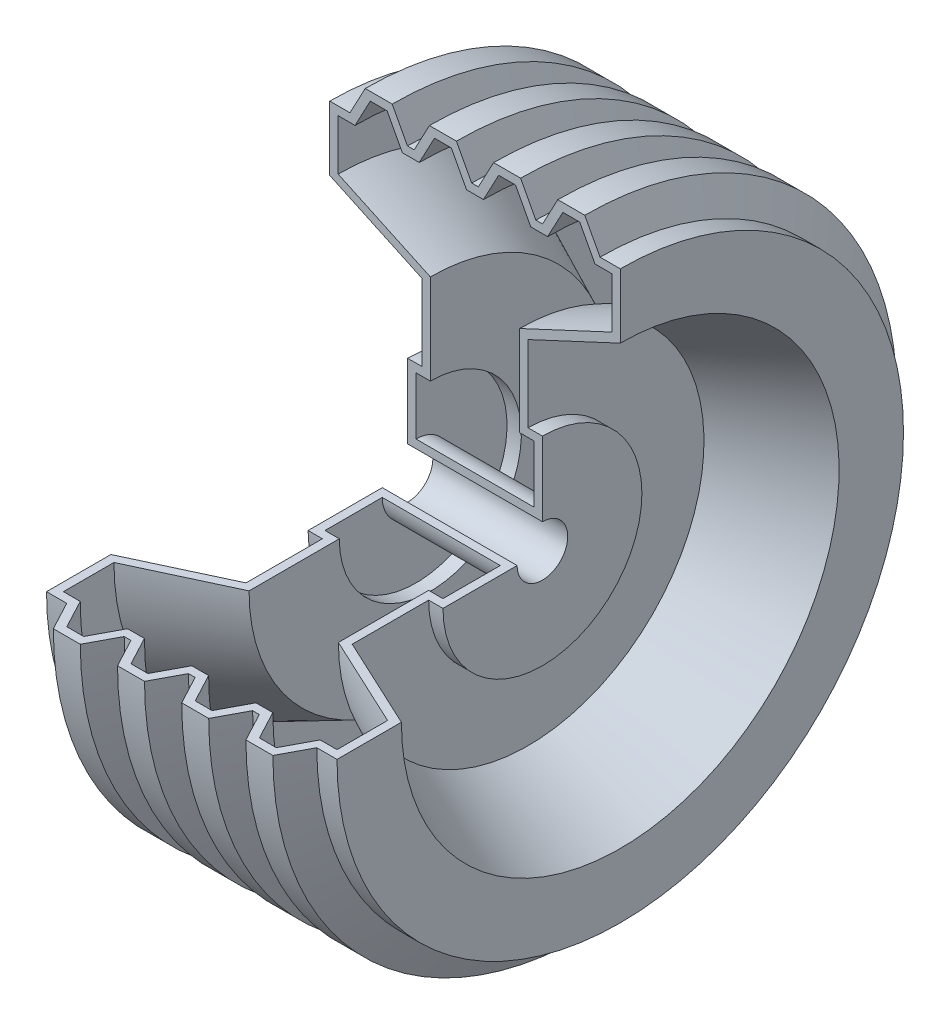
ISO-10303-21;
HEADER;
FILE_DESCRIPTION(('STEP AP214'),'2;1');
FILE_NAME('part.step','',(''),(''),'','','');
FILE_SCHEMA(('AUTOMOTIVE_DESIGN { 1 0 10303 214 1 1 1 1 }'));
ENDSEC;
DATA;
#1=APPLICATION_CONTEXT('core data for automotive mechanical design processes');
#2=APPLICATION_PROTOCOL_DEFINITION('international standard','automotive_design',2000,#1);
#3=PRODUCT_CONTEXT('',#1,'mechanical');
#4=PRODUCT('Part','Part','',(#3));
#5=PRODUCT_RELATED_PRODUCT_CATEGORY('part','',(#4));
#6=PRODUCT_DEFINITION_FORMATION('','',#4);
#7=PRODUCT_DEFINITION_CONTEXT('part definition',#1,'design');
#8=PRODUCT_DEFINITION('design','',#6,#7);
#9=PRODUCT_DEFINITION_SHAPE('','',#8);
#10=(LENGTH_UNIT() NAMED_UNIT(*) SI_UNIT(.MILLI.,.METRE.));
#11=(NAMED_UNIT(*) PLANE_ANGLE_UNIT() SI_UNIT($,.RADIAN.));
#12=(NAMED_UNIT(*) SI_UNIT($,.STERADIAN.) SOLID_ANGLE_UNIT());
#13=UNCERTAINTY_MEASURE_WITH_UNIT(LENGTH_MEASURE(1.E-05),#10,'distance_accuracy_value','');
#14=(GEOMETRIC_REPRESENTATION_CONTEXT(3) GLOBAL_UNCERTAINTY_ASSIGNED_CONTEXT((#13)) GLOBAL_UNIT_ASSIGNED_CONTEXT((#10,
#11,#12)) REPRESENTATION_CONTEXT('',''));
#15=CARTESIAN_POINT('',(0.,0.,0.));
#16=DIRECTION('',(0.,0.,1.));
#17=DIRECTION('',(1.,0.,0.));
#18=AXIS2_PLACEMENT_3D('',#15,#16,#17);
#19=CARTESIAN_POINT('',(-56.6546528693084,0.,0.));
#20=DIRECTION('',(1.,0.,0.));
#21=DIRECTION('',(0.,0.,-1.));
#22=AXIS2_PLACEMENT_3D('',#19,#20,#21);
#23=CYLINDRICAL_SURFACE('',#22,59.);
#24=CARTESIAN_POINT('',(-40.,0.,0.));
#25=DIRECTION('',(1.,0.,0.));
#26=DIRECTION('',(0.,0.,-1.));
#27=AXIS2_PLACEMENT_3D('',#24,#25,#26);
#28=CIRCLE('',#27,59.);
#29=CARTESIAN_POINT('',(-40.,6.17992196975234E-13,59.));
#30=VERTEX_POINT('',#29);
#31=CARTESIAN_POINT('',(-40.,59.,0.));
#32=VERTEX_POINT('',#31);
#33=EDGE_CURVE('E11',#30,#32,#28,.T.);
#34=ORIENTED_EDGE('',*,*,#33,.T.);
#35=DIRECTION('',(-1.,0.,0.));
#36=VECTOR('',#35,1.);
#37=CARTESIAN_POINT('',(-35.,59.,0.));
#38=LINE('',#37,#36);
#39=CARTESIAN_POINT('',(-31.5,59.,0.));
#40=VERTEX_POINT('',#39);
#41=EDGE_CURVE('E393',#40,#32,#38,.T.);
#42=ORIENTED_EDGE('',*,*,#41,.F.);
#43=CARTESIAN_POINT('',(-31.5,0.,0.));
#44=DIRECTION('',(1.,0.,0.));
#45=DIRECTION('',(0.,0.,-1.));
#46=AXIS2_PLACEMENT_3D('',#43,#44,#45);
#47=CIRCLE('',#46,59.);
#48=CARTESIAN_POINT('',(-31.5,6.17992196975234E-13,59.));
#49=VERTEX_POINT('',#48);
#50=EDGE_CURVE('E783',#49,#40,#47,.T.);
#51=ORIENTED_EDGE('',*,*,#50,.F.);
#52=DIRECTION('',(-1.,0.,0.));
#53=VECTOR('',#52,1.);
#54=CARTESIAN_POINT('',(-35.,6.17992196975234E-13,59.));
#55=LINE('',#54,#53);
#56=EDGE_CURVE('E699',#49,#30,#55,.T.);
#57=ORIENTED_EDGE('',*,*,#56,.T.);
#58=EDGE_LOOP('',(#34,#42,#51,#57));
#59=FACE_BOUND('',#58,.T.);
#60=ADVANCED_FACE('F33',(#59),#23,.T.);
#61=CARTESIAN_POINT('',(-40.,2.09488880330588E-13,20.));
#62=DIRECTION('',(-1.,0.,0.));
#63=DIRECTION('',(0.,0.,1.));
#64=AXIS2_PLACEMENT_3D('',#61,#62,#63);
#65=PLANE('',#64);
#66=CARTESIAN_POINT('',(-40.,0.,0.));
#67=DIRECTION('',(1.,0.,0.));
#68=DIRECTION('',(0.,0.,-1.));
#69=AXIS2_PLACEMENT_3D('',#66,#67,#68);
#70=CIRCLE('',#69,15.);
#71=CARTESIAN_POINT('',(-40.,1.57116660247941E-13,15.));
#72=VERTEX_POINT('',#71);
#73=CARTESIAN_POINT('',(-40.,15.,0.));
#74=VERTEX_POINT('',#73);
#75=EDGE_CURVE('E41',#72,#74,#70,.T.);
#76=ORIENTED_EDGE('',*,*,#75,.T.);
#77=DIRECTION('',(0.,-1.,0.));
#78=VECTOR('',#77,1.);
#79=CARTESIAN_POINT('',(-40.,20.,0.));
#80=LINE('',#79,#78);
#81=EDGE_CURVE('E618',#32,#74,#80,.T.);
#82=ORIENTED_EDGE('',*,*,#81,.F.);
#83=ORIENTED_EDGE('',*,*,#33,.F.);
#84=DIRECTION('',(0.,0.,-1.));
#85=VECTOR('',#84,1.);
#86=CARTESIAN_POINT('',(-40.,2.09488880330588E-13,20.));
#87=LINE('',#86,#85);
#88=EDGE_CURVE('E702',#30,#72,#87,.T.);
#89=ORIENTED_EDGE('',*,*,#88,.T.);
#90=EDGE_LOOP('',(#76,#82,#83,#89));
#91=FACE_BOUND('',#90,.T.);
#92=ADVANCED_FACE('F35',(#91),#65,.T.);
#93=CARTESIAN_POINT('',(-56.6546528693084,0.,0.));
#94=DIRECTION('',(1.,0.,0.));
#95=DIRECTION('',(0.,0.,-1.));
#96=AXIS2_PLACEMENT_3D('',#93,#94,#95);
#97=CYLINDRICAL_SURFACE('',#96,15.);
#98=CARTESIAN_POINT('',(40.,0.,0.));
#99=DIRECTION('',(1.,0.,0.));
#100=DIRECTION('',(0.,0.,-1.));
#101=AXIS2_PLACEMENT_3D('',#98,#99,#100);
#102=CIRCLE('',#101,15.);
#103=CARTESIAN_POINT('',(40.,1.57116660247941E-13,15.));
#104=VERTEX_POINT('',#103);
#105=CARTESIAN_POINT('',(40.,15.,0.));
#106=VERTEX_POINT('',#105);
#107=EDGE_CURVE('E833',#104,#106,#102,.T.);
#108=ORIENTED_EDGE('',*,*,#107,.T.);
#109=DIRECTION('',(1.,0.,0.));
#110=VECTOR('',#109,1.);
#111=CARTESIAN_POINT('',(-35.,15.,0.));
#112=LINE('',#111,#110);
#113=EDGE_CURVE('E621',#74,#106,#112,.T.);
#114=ORIENTED_EDGE('',*,*,#113,.F.);
#115=ORIENTED_EDGE('',*,*,#75,.F.);
#116=DIRECTION('',(1.,0.,0.));
#117=VECTOR('',#116,1.);
#118=CARTESIAN_POINT('',(-35.,1.57116660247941E-13,15.));
#119=LINE('',#118,#117);
#120=EDGE_CURVE('E705',#72,#104,#119,.T.);
#121=ORIENTED_EDGE('',*,*,#120,.T.);
#122=EDGE_LOOP('',(#108,#114,#115,#121));
#123=FACE_BOUND('',#122,.T.);
#124=ADVANCED_FACE('F842',(#123),#97,.F.);
#125=CARTESIAN_POINT('',(40.,2.09488880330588E-13,20.));
#126=DIRECTION('',(1.,0.,0.));
#127=DIRECTION('',(0.,0.,-1.));
#128=AXIS2_PLACEMENT_3D('',#125,#126,#127);
#129=PLANE('',#128);
#130=CARTESIAN_POINT('',(40.,0.,0.));
#131=DIRECTION('',(1.,0.,0.));
#132=DIRECTION('',(0.,0.,-1.));
#133=AXIS2_PLACEMENT_3D('',#130,#131,#132);
#134=CIRCLE('',#133,59.);
#135=CARTESIAN_POINT('',(40.,6.17992196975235E-13,59.));
#136=VERTEX_POINT('',#135);
#137=CARTESIAN_POINT('',(40.,59.,0.));
#138=VERTEX_POINT('',#137);
#139=EDGE_CURVE('E831',#136,#138,#134,.T.);
#140=ORIENTED_EDGE('',*,*,#139,.T.);
#141=DIRECTION('',(0.,1.,0.));
#142=VECTOR('',#141,1.);
#143=CARTESIAN_POINT('',(40.,20.,0.));
#144=LINE('',#143,#142);
#145=EDGE_CURVE('E624',#106,#138,#144,.T.);
#146=ORIENTED_EDGE('',*,*,#145,.F.);
#147=ORIENTED_EDGE('',*,*,#107,.F.);
#148=DIRECTION('',(0.,0.,1.));
#149=VECTOR('',#148,1.);
#150=CARTESIAN_POINT('',(40.,2.09488880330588E-13,20.));
#151=LINE('',#150,#149);
#152=EDGE_CURVE('E708',#104,#136,#151,.T.);
#153=ORIENTED_EDGE('',*,*,#152,.T.);
#154=EDGE_LOOP('',(#140,#146,#147,#153));
#155=FACE_BOUND('',#154,.T.);
#156=ADVANCED_FACE('F845',(#155),#129,.T.);
#157=CARTESIAN_POINT('',(-56.6546528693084,0.,0.));
#158=DIRECTION('',(1.,0.,0.));
#159=DIRECTION('',(0.,0.,-1.));
#160=AXIS2_PLACEMENT_3D('',#157,#158,#159);
#161=CYLINDRICAL_SURFACE('',#160,59.);
#162=CARTESIAN_POINT('',(31.5,0.,0.));
#163=DIRECTION('',(1.,0.,0.));
#164=DIRECTION('',(0.,0.,-1.));
#165=AXIS2_PLACEMENT_3D('',#162,#163,#164);
#166=CIRCLE('',#165,59.);
#167=CARTESIAN_POINT('',(31.5,6.17992196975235E-13,59.));
#168=VERTEX_POINT('',#167);
#169=CARTESIAN_POINT('',(31.5,59.,0.));
#170=VERTEX_POINT('',#169);
#171=EDGE_CURVE('E829',#168,#170,#166,.T.);
#172=ORIENTED_EDGE('',*,*,#171,.T.);
#173=DIRECTION('',(-1.,0.,0.));
#174=VECTOR('',#173,1.);
#175=CARTESIAN_POINT('',(35.,59.,0.));
#176=LINE('',#175,#174);
#177=EDGE_CURVE('E627',#138,#170,#176,.T.);
#178=ORIENTED_EDGE('',*,*,#177,.F.);
#179=ORIENTED_EDGE('',*,*,#139,.F.);
#180=DIRECTION('',(-1.,0.,0.));
#181=VECTOR('',#180,1.);
#182=CARTESIAN_POINT('',(35.,6.17992196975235E-13,59.));
#183=LINE('',#182,#181);
#184=EDGE_CURVE('E711',#136,#168,#183,.T.);
#185=ORIENTED_EDGE('',*,*,#184,.T.);
#186=EDGE_LOOP('',(#172,#178,#179,#185));
#187=FACE_BOUND('',#186,.T.);
#188=ADVANCED_FACE('F850',(#187),#161,.T.);
#189=CARTESIAN_POINT('',(31.5,5.65619976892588E-13,54.));
#190=DIRECTION('',(1.,0.,0.));
#191=DIRECTION('',(0.,0.,-1.));
#192=AXIS2_PLACEMENT_3D('',#189,#190,#191);
#193=PLANE('',#192);
#194=CARTESIAN_POINT('',(31.5,0.,0.));
#195=DIRECTION('',(1.,0.,0.));
#196=DIRECTION('',(0.,0.,-1.));
#197=AXIS2_PLACEMENT_3D('',#194,#195,#196);
#198=CIRCLE('',#197,104.328024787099);
#199=CARTESIAN_POINT('',(31.5,1.09277805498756E-12,104.328024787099));
#200=VERTEX_POINT('',#199);
#201=CARTESIAN_POINT('',(31.5,104.328024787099,0.));
#202=VERTEX_POINT('',#201);
#203=EDGE_CURVE('E827',#200,#202,#198,.T.);
#204=ORIENTED_EDGE('',*,*,#203,.T.);
#205=DIRECTION('',(0.,1.,0.));
#206=VECTOR('',#205,1.);
#207=CARTESIAN_POINT('',(31.5,54.,0.));
#208=LINE('',#207,#206);
#209=EDGE_CURVE('E630',#170,#202,#208,.T.);
#210=ORIENTED_EDGE('',*,*,#209,.F.);
#211=ORIENTED_EDGE('',*,*,#171,.F.);
#212=DIRECTION('',(0.,0.,1.));
#213=VECTOR('',#212,1.);
#214=CARTESIAN_POINT('',(31.5,5.65619976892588E-13,54.));
#215=LINE('',#214,#213);
#216=EDGE_CURVE('E714',#168,#200,#215,.T.);
#217=ORIENTED_EDGE('',*,*,#216,.T.);
#218=EDGE_LOOP('',(#204,#210,#211,#217));
#219=FACE_BOUND('',#218,.T.);
#220=ADVANCED_FACE('F853',(#219),#193,.T.);
#221=CARTESIAN_POINT('',(31.5,0.,0.));
#222=DIRECTION('',(1.,0.,0.));
#223=DIRECTION('',(0.,0.,-1.));
#224=AXIS2_PLACEMENT_3D('',#221,#222,#223);
#225=CONICAL_SURFACE('',#224,104.328024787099,0.436332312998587);
#226=CARTESIAN_POINT('',(86.1562413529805,0.,0.));
#227=DIRECTION('',(1.,0.,0.));
#228=DIRECTION('',(0.,0.,-1.));
#229=AXIS2_PLACEMENT_3D('',#226,#227,#228);
#230=CIRCLE('',#229,129.814648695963);
#231=CARTESIAN_POINT('',(86.1562413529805,1.35973627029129E-12,129.814648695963));
#232=VERTEX_POINT('',#231);
#233=CARTESIAN_POINT('',(86.1562413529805,129.814648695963,0.));
#234=VERTEX_POINT('',#233);
#235=EDGE_CURVE('E825',#232,#234,#230,.T.);
#236=ORIENTED_EDGE('',*,*,#235,.T.);
#237=DIRECTION('',(0.906307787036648,0.422618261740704,0.));
#238=VECTOR('',#237,1.);
#239=CARTESIAN_POINT('',(28.6130913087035,102.981837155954,0.));
#240=LINE('',#239,#238);
#241=EDGE_CURVE('E633',#202,#234,#240,.T.);
#242=ORIENTED_EDGE('',*,*,#241,.F.);
#243=ORIENTED_EDGE('',*,*,#203,.F.);
#244=DIRECTION('',(0.906307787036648,0.,0.422618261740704));
#245=VECTOR('',#244,1.);
#246=CARTESIAN_POINT('',(28.6130913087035,1.07867748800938E-12,102.981837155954));
#247=LINE('',#246,#245);
#248=EDGE_CURVE('E717',#200,#232,#247,.T.);
#249=ORIENTED_EDGE('',*,*,#248,.T.);
#250=EDGE_LOOP('',(#236,#242,#243,#249));
#251=FACE_BOUND('',#250,.T.);
#252=ADVANCED_FACE('F858',(#251),#225,.F.);
#253=CARTESIAN_POINT('',(86.1562413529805,1.39310105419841E-12,133.));
#254=DIRECTION('',(1.,0.,0.));
#255=DIRECTION('',(0.,0.,-1.));
#256=AXIS2_PLACEMENT_3D('',#253,#254,#255);
#257=PLANE('',#256);
#258=CARTESIAN_POINT('',(86.1562413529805,0.,0.));
#259=DIRECTION('',(1.,0.,0.));
#260=DIRECTION('',(0.,0.,-1.));
#261=AXIS2_PLACEMENT_3D('',#258,#259,#260);
#262=CIRCLE('',#261,168.);
#263=CARTESIAN_POINT('',(86.1562413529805,1.75970659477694E-12,168.));
#264=VERTEX_POINT('',#263);
#265=CARTESIAN_POINT('',(86.1562413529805,168.,0.));
#266=VERTEX_POINT('',#265);
#267=EDGE_CURVE('E823',#264,#266,#262,.T.);
#268=ORIENTED_EDGE('',*,*,#267,.T.);
#269=DIRECTION('',(0.,1.,0.));
#270=VECTOR('',#269,1.);
#271=CARTESIAN_POINT('',(86.1562413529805,133.,0.));
#272=LINE('',#271,#270);
#273=EDGE_CURVE('E636',#234,#266,#272,.T.);
#274=ORIENTED_EDGE('',*,*,#273,.F.);
#275=ORIENTED_EDGE('',*,*,#235,.F.);
#276=DIRECTION('',(0.,0.,1.));
#277=VECTOR('',#276,1.);
#278=CARTESIAN_POINT('',(86.1562413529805,1.39310105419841E-12,133.));
#279=LINE('',#278,#277);
#280=EDGE_CURVE('E720',#232,#264,#279,.T.);
#281=ORIENTED_EDGE('',*,*,#280,.T.);
#282=EDGE_LOOP('',(#268,#274,#275,#281));
#283=FACE_BOUND('',#282,.T.);
#284=ADVANCED_FACE('F861',(#283),#257,.T.);
#285=CARTESIAN_POINT('',(-56.6546528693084,0.,0.));
#286=DIRECTION('',(1.,0.,0.));
#287=DIRECTION('',(0.,0.,-1.));
#288=AXIS2_PLACEMENT_3D('',#285,#286,#287);
#289=CYLINDRICAL_SURFACE('',#288,168.);
#290=CARTESIAN_POINT('',(74.1605444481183,0.,0.));
#291=DIRECTION('',(1.,0.,0.));
#292=DIRECTION('',(0.,0.,-1.));
#293=AXIS2_PLACEMENT_3D('',#290,#291,#292);
#294=CIRCLE('',#293,168.);
#295=CARTESIAN_POINT('',(74.1605444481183,1.75970659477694E-12,168.));
#296=VERTEX_POINT('',#295);
#297=CARTESIAN_POINT('',(74.1605444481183,168.,0.));
#298=VERTEX_POINT('',#297);
#299=EDGE_CURVE('E821',#296,#298,#294,.T.);
#300=ORIENTED_EDGE('',*,*,#299,.T.);
#301=DIRECTION('',(-1.,0.,0.));
#302=VECTOR('',#301,1.);
#303=CARTESIAN_POINT('',(81.1562413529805,168.,0.));
#304=LINE('',#303,#302);
#305=EDGE_CURVE('E639',#266,#298,#304,.T.);
#306=ORIENTED_EDGE('',*,*,#305,.F.);
#307=ORIENTED_EDGE('',*,*,#267,.F.);
#308=DIRECTION('',(-1.,0.,0.));
#309=VECTOR('',#308,1.);
#310=CARTESIAN_POINT('',(81.1562413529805,1.75970659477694E-12,168.));
#311=LINE('',#310,#309);
#312=EDGE_CURVE('E723',#264,#296,#311,.T.);
#313=ORIENTED_EDGE('',*,*,#312,.T.);
#314=EDGE_LOOP('',(#300,#306,#307,#313));
#315=FACE_BOUND('',#314,.T.);
#316=ADVANCED_FACE('F866',(#315),#289,.T.);
#317=CARTESIAN_POINT('',(74.1605444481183,0.,0.));
#318=DIRECTION('',(-1.,0.,0.));
#319=DIRECTION('',(0.,0.,1.));
#320=AXIS2_PLACEMENT_3D('',#317,#318,#319);
#321=CONICAL_SURFACE('',#320,168.,1.08210413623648);
#322=CARTESIAN_POINT('',(65.1214841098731,0.,0.));
#323=DIRECTION('',(1.,0.,0.));
#324=DIRECTION('',(0.,0.,-1.));
#325=AXIS2_PLACEMENT_3D('',#322,#323,#324);
#326=CIRCLE('',#325,185.);
#327=CARTESIAN_POINT('',(65.1214841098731,1.93777214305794E-12,185.));
#328=VERTEX_POINT('',#327);
#329=CARTESIAN_POINT('',(65.1214841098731,185.,0.));
#330=VERTEX_POINT('',#329);
#331=EDGE_CURVE('E819',#328,#330,#326,.T.);
#332=ORIENTED_EDGE('',*,*,#331,.T.);
#333=DIRECTION('',(-0.469471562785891,0.882947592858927,0.));
#334=VECTOR('',#333,1.);
#335=CARTESIAN_POINT('',(75.5709793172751,165.347357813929,0.));
#336=LINE('',#335,#334);
#337=EDGE_CURVE('E642',#298,#330,#336,.T.);
#338=ORIENTED_EDGE('',*,*,#337,.F.);
#339=ORIENTED_EDGE('',*,*,#299,.F.);
#340=DIRECTION('',(-0.469471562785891,0.,0.882947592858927));
#341=VECTOR('',#340,1.);
#342=CARTESIAN_POINT('',(75.5709793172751,1.73192164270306E-12,165.347357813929));
#343=LINE('',#342,#341);
#344=EDGE_CURVE('E726',#296,#328,#343,.T.);
#345=ORIENTED_EDGE('',*,*,#344,.T.);
#346=EDGE_LOOP('',(#332,#338,#339,#345));
#347=FACE_BOUND('',#346,.T.);
#348=ADVANCED_FACE('F869',(#347),#321,.T.);
#349=CARTESIAN_POINT('',(-56.6546528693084,0.,0.));
#350=DIRECTION('',(1.,0.,0.));
#351=DIRECTION('',(0.,0.,-1.));
#352=AXIS2_PLACEMENT_3D('',#349,#350,#351);
#353=CYLINDRICAL_SURFACE('',#352,185.);
#354=CARTESIAN_POINT('',(49.1128779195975,0.,0.));
#355=DIRECTION('',(1.,0.,0.));
#356=DIRECTION('',(0.,0.,-1.));
#357=AXIS2_PLACEMENT_3D('',#354,#355,#356);
#358=CIRCLE('',#357,185.);
#359=CARTESIAN_POINT('',(49.1128779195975,1.93777214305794E-12,185.));
#360=VERTEX_POINT('',#359);
#361=CARTESIAN_POINT('',(49.1128779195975,185.,0.));
#362=VERTEX_POINT('',#361);
#363=EDGE_CURVE('E817',#360,#362,#358,.T.);
#364=ORIENTED_EDGE('',*,*,#363,.T.);
#365=DIRECTION('',(-1.,0.,0.));
#366=VECTOR('',#365,1.);
#367=CARTESIAN_POINT('',(62.1171810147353,185.,0.));
#368=LINE('',#367,#366);
#369=EDGE_CURVE('E645',#330,#362,#368,.T.);
#370=ORIENTED_EDGE('',*,*,#369,.F.);
#371=ORIENTED_EDGE('',*,*,#331,.F.);
#372=DIRECTION('',(-1.,0.,0.));
#373=VECTOR('',#372,1.);
#374=CARTESIAN_POINT('',(62.1171810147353,1.93777214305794E-12,185.));
#375=LINE('',#374,#373);
#376=EDGE_CURVE('E729',#328,#360,#375,.T.);
#377=ORIENTED_EDGE('',*,*,#376,.T.);
#378=EDGE_LOOP('',(#364,#370,#371,#377));
#379=FACE_BOUND('',#378,.T.);
#380=ADVANCED_FACE('F874',(#379),#353,.T.);
#381=CARTESIAN_POINT('',(49.1128779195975,0.,0.));
#382=DIRECTION('',(1.,0.,0.));
#383=DIRECTION('',(0.,0.,-1.));
#384=AXIS2_PLACEMENT_3D('',#381,#382,#383);
#385=CONICAL_SURFACE('',#384,185.,1.08210413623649);
#386=CARTESIAN_POINT('',(40.0738175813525,0.,0.));
#387=DIRECTION('',(1.,0.,0.));
#388=DIRECTION('',(0.,0.,-1.));
#389=AXIS2_PLACEMENT_3D('',#386,#387,#388);
#390=CIRCLE('',#389,168.);
#391=CARTESIAN_POINT('',(40.0738175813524,1.75970659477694E-12,168.));
#392=VERTEX_POINT('',#391);
#393=CARTESIAN_POINT('',(40.0738175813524,168.,0.));
#394=VERTEX_POINT('',#393);
#395=EDGE_CURVE('E815',#392,#394,#390,.T.);
#396=ORIENTED_EDGE('',*,*,#395,.T.);
#397=DIRECTION('',(-0.46947156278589,-0.882947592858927,0.));
#398=VECTOR('',#397,1.);
#399=CARTESIAN_POINT('',(47.7024430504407,182.347357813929,0.));
#400=LINE('',#399,#398);
#401=EDGE_CURVE('E648',#362,#394,#400,.T.);
#402=ORIENTED_EDGE('',*,*,#401,.F.);
#403=ORIENTED_EDGE('',*,*,#363,.F.);
#404=DIRECTION('',(-0.46947156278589,0.,-0.882947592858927));
#405=VECTOR('',#404,1.);
#406=CARTESIAN_POINT('',(47.7024430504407,1.90998719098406E-12,182.347357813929));
#407=LINE('',#406,#405);
#408=EDGE_CURVE('E732',#360,#392,#407,.T.);
#409=ORIENTED_EDGE('',*,*,#408,.T.);
#410=EDGE_LOOP('',(#396,#402,#403,#409));
#411=FACE_BOUND('',#410,.T.);
#412=ADVANCED_FACE('F877',(#411),#385,.T.);
#413=CARTESIAN_POINT('',(-56.6546528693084,0.,0.));
#414=DIRECTION('',(1.,0.,0.));
#415=DIRECTION('',(0.,0.,-1.));
#416=AXIS2_PLACEMENT_3D('',#413,#414,#415);
#417=CYLINDRICAL_SURFACE('',#416,168.);
#418=CARTESIAN_POINT('',(36.082423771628,0.,0.));
#419=DIRECTION('',(1.,0.,0.));
#420=DIRECTION('',(0.,0.,-1.));
#421=AXIS2_PLACEMENT_3D('',#418,#419,#420);
#422=CIRCLE('',#421,168.);
#423=CARTESIAN_POINT('',(36.0824237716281,1.75970659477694E-12,168.));
#424=VERTEX_POINT('',#423);
#425=CARTESIAN_POINT('',(36.0824237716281,168.,0.));
#426=VERTEX_POINT('',#425);
#427=EDGE_CURVE('E813',#424,#426,#422,.T.);
#428=ORIENTED_EDGE('',*,*,#427,.T.);
#429=DIRECTION('',(-1.,0.,0.));
#430=VECTOR('',#429,1.);
#431=CARTESIAN_POINT('',(43.0781206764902,168.,0.));
#432=LINE('',#431,#430);
#433=EDGE_CURVE('E651',#394,#426,#432,.T.);
#434=ORIENTED_EDGE('',*,*,#433,.F.);
#435=ORIENTED_EDGE('',*,*,#395,.F.);
#436=DIRECTION('',(-1.,0.,0.));
#437=VECTOR('',#436,1.);
#438=CARTESIAN_POINT('',(43.0781206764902,1.75970659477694E-12,168.));
#439=LINE('',#438,#437);
#440=EDGE_CURVE('E735',#392,#424,#439,.T.);
#441=ORIENTED_EDGE('',*,*,#440,.T.);
#442=EDGE_LOOP('',(#428,#434,#435,#441));
#443=FACE_BOUND('',#442,.T.);
#444=ADVANCED_FACE('F882',(#443),#417,.T.);
#445=CARTESIAN_POINT('',(36.082423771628,0.,0.));
#446=DIRECTION('',(-1.,0.,0.));
#447=DIRECTION('',(0.,0.,1.));
#448=AXIS2_PLACEMENT_3D('',#445,#446,#447);
#449=CONICAL_SURFACE('',#448,168.,1.08210413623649);
#450=CARTESIAN_POINT('',(27.0433634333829,0.,0.));
#451=DIRECTION('',(1.,0.,0.));
#452=DIRECTION('',(0.,0.,-1.));
#453=AXIS2_PLACEMENT_3D('',#450,#451,#452);
#454=CIRCLE('',#453,185.);
#455=CARTESIAN_POINT('',(27.0433634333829,1.93777214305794E-12,185.));
#456=VERTEX_POINT('',#455);
#457=CARTESIAN_POINT('',(27.0433634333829,185.,0.));
#458=VERTEX_POINT('',#457);
#459=EDGE_CURVE('E811',#456,#458,#454,.T.);
#460=ORIENTED_EDGE('',*,*,#459,.T.);
#461=DIRECTION('',(-0.46947156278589,0.882947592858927,0.));
#462=VECTOR('',#461,1.);
#463=CARTESIAN_POINT('',(37.4928586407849,165.347357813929,0.));
#464=LINE('',#463,#462);
#465=EDGE_CURVE('E654',#426,#458,#464,.T.);
#466=ORIENTED_EDGE('',*,*,#465,.F.);
#467=ORIENTED_EDGE('',*,*,#427,.F.);
#468=DIRECTION('',(-0.46947156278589,0.,0.882947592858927));
#469=VECTOR('',#468,1.);
#470=CARTESIAN_POINT('',(37.4928586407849,1.73192164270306E-12,165.347357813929));
#471=LINE('',#470,#469);
#472=EDGE_CURVE('E738',#424,#456,#471,.T.);
#473=ORIENTED_EDGE('',*,*,#472,.T.);
#474=EDGE_LOOP('',(#460,#466,#467,#473));
#475=FACE_BOUND('',#474,.T.);
#476=ADVANCED_FACE('F885',(#475),#449,.T.);
#477=CARTESIAN_POINT('',(-56.6546528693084,0.,0.));
#478=DIRECTION('',(1.,0.,0.));
#479=DIRECTION('',(0.,0.,-1.));
#480=AXIS2_PLACEMENT_3D('',#477,#478,#479);
#481=CYLINDRICAL_SURFACE('',#480,185.);
#482=CARTESIAN_POINT('',(11.0347572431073,0.,0.));
#483=DIRECTION('',(1.,0.,0.));
#484=DIRECTION('',(0.,0.,-1.));
#485=AXIS2_PLACEMENT_3D('',#482,#483,#484);
#486=CIRCLE('',#485,185.);
#487=CARTESIAN_POINT('',(11.0347572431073,1.93777214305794E-12,185.));
#488=VERTEX_POINT('',#487);
#489=CARTESIAN_POINT('',(11.0347572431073,185.,0.));
#490=VERTEX_POINT('',#489);
#491=EDGE_CURVE('E809',#488,#490,#486,.T.);
#492=ORIENTED_EDGE('',*,*,#491,.T.);
#493=DIRECTION('',(-1.,0.,0.));
#494=VECTOR('',#493,1.);
#495=CARTESIAN_POINT('',(24.0390603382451,185.,0.));
#496=LINE('',#495,#494);
#497=EDGE_CURVE('E657',#458,#490,#496,.T.);
#498=ORIENTED_EDGE('',*,*,#497,.F.);
#499=ORIENTED_EDGE('',*,*,#459,.F.);
#500=DIRECTION('',(-1.,0.,0.));
#501=VECTOR('',#500,1.);
#502=CARTESIAN_POINT('',(24.0390603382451,1.93777214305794E-12,185.));
#503=LINE('',#502,#501);
#504=EDGE_CURVE('E741',#456,#488,#503,.T.);
#505=ORIENTED_EDGE('',*,*,#504,.T.);
#506=EDGE_LOOP('',(#492,#498,#499,#505));
#507=FACE_BOUND('',#506,.T.);
#508=ADVANCED_FACE('F890',(#507),#481,.T.);
#509=CARTESIAN_POINT('',(11.0347572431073,0.,0.));
#510=DIRECTION('',(1.,0.,0.));
#511=DIRECTION('',(0.,0.,-1.));
#512=AXIS2_PLACEMENT_3D('',#509,#510,#511);
#513=CONICAL_SURFACE('',#512,185.,1.08210413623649);
#514=CARTESIAN_POINT('',(1.99569690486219,0.,0.));
#515=DIRECTION('',(1.,0.,0.));
#516=DIRECTION('',(0.,0.,-1.));
#517=AXIS2_PLACEMENT_3D('',#514,#515,#516);
#518=CIRCLE('',#517,168.);
#519=CARTESIAN_POINT('',(1.99569690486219,1.75970659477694E-12,168.));
#520=VERTEX_POINT('',#519);
#521=CARTESIAN_POINT('',(1.99569690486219,168.,0.));
#522=VERTEX_POINT('',#521);
#523=EDGE_CURVE('E807',#520,#522,#518,.T.);
#524=ORIENTED_EDGE('',*,*,#523,.T.);
#525=DIRECTION('',(-0.469471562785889,-0.882947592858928,0.));
#526=VECTOR('',#525,1.);
#527=CARTESIAN_POINT('',(9.62432237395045,182.347357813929,0.));
#528=LINE('',#527,#526);
#529=EDGE_CURVE('E660',#490,#522,#528,.T.);
#530=ORIENTED_EDGE('',*,*,#529,.F.);
#531=ORIENTED_EDGE('',*,*,#491,.F.);
#532=DIRECTION('',(-0.469471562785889,0.,-0.882947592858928));
#533=VECTOR('',#532,1.);
#534=CARTESIAN_POINT('',(9.62432237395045,1.90998719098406E-12,182.347357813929));
#535=LINE('',#534,#533);
#536=EDGE_CURVE('E744',#488,#520,#535,.T.);
#537=ORIENTED_EDGE('',*,*,#536,.T.);
#538=EDGE_LOOP('',(#524,#530,#531,#537));
#539=FACE_BOUND('',#538,.T.);
#540=ADVANCED_FACE('F893',(#539),#513,.T.);
#541=CARTESIAN_POINT('',(-56.6546528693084,0.,0.));
#542=DIRECTION('',(1.,0.,0.));
#543=DIRECTION('',(0.,0.,-1.));
#544=AXIS2_PLACEMENT_3D('',#541,#542,#543);
#545=CYLINDRICAL_SURFACE('',#544,168.);
#546=CARTESIAN_POINT('',(-1.9956969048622,0.,0.));
#547=DIRECTION('',(1.,0.,0.));
#548=DIRECTION('',(0.,0.,-1.));
#549=AXIS2_PLACEMENT_3D('',#546,#547,#548);
#550=CIRCLE('',#549,168.);
#551=CARTESIAN_POINT('',(-1.9956969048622,1.75970659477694E-12,168.));
#552=VERTEX_POINT('',#551);
#553=CARTESIAN_POINT('',(-1.9956969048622,168.,0.));
#554=VERTEX_POINT('',#553);
#555=EDGE_CURVE('E805',#552,#554,#550,.T.);
#556=ORIENTED_EDGE('',*,*,#555,.T.);
#557=DIRECTION('',(-1.,0.,0.));
#558=VECTOR('',#557,1.);
#559=CARTESIAN_POINT('',(5.,168.,0.));
#560=LINE('',#559,#558);
#561=EDGE_CURVE('E663',#522,#554,#560,.T.);
#562=ORIENTED_EDGE('',*,*,#561,.F.);
#563=ORIENTED_EDGE('',*,*,#523,.F.);
#564=DIRECTION('',(-1.,0.,0.));
#565=VECTOR('',#564,1.);
#566=CARTESIAN_POINT('',(5.,1.75970659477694E-12,168.));
#567=LINE('',#566,#565);
#568=EDGE_CURVE('E747',#520,#552,#567,.T.);
#569=ORIENTED_EDGE('',*,*,#568,.T.);
#570=EDGE_LOOP('',(#556,#562,#563,#569));
#571=FACE_BOUND('',#570,.T.);
#572=ADVANCED_FACE('F898',(#571),#545,.T.);
#573=CARTESIAN_POINT('',(-1.9956969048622,0.,0.));
#574=DIRECTION('',(-1.,0.,0.));
#575=DIRECTION('',(0.,0.,1.));
#576=AXIS2_PLACEMENT_3D('',#573,#574,#575);
#577=CONICAL_SURFACE('',#576,168.,1.08210413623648);
#578=CARTESIAN_POINT('',(-11.0347572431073,0.,0.));
#579=DIRECTION('',(1.,0.,0.));
#580=DIRECTION('',(0.,0.,-1.));
#581=AXIS2_PLACEMENT_3D('',#578,#579,#580);
#582=CIRCLE('',#581,185.);
#583=CARTESIAN_POINT('',(-11.0347572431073,1.93777214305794E-12,185.));
#584=VERTEX_POINT('',#583);
#585=CARTESIAN_POINT('',(-11.0347572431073,185.,0.));
#586=VERTEX_POINT('',#585);
#587=EDGE_CURVE('E803',#584,#586,#582,.T.);
#588=ORIENTED_EDGE('',*,*,#587,.T.);
#589=DIRECTION('',(-0.46947156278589,0.882947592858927,0.));
#590=VECTOR('',#589,1.);
#591=CARTESIAN_POINT('',(-9.62432237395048,182.347357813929,0.));
#592=LINE('',#591,#590);
#593=EDGE_CURVE('E666',#554,#586,#592,.T.);
#594=ORIENTED_EDGE('',*,*,#593,.F.);
#595=ORIENTED_EDGE('',*,*,#555,.F.);
#596=DIRECTION('',(-0.46947156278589,0.,0.882947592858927));
#597=VECTOR('',#596,1.);
#598=CARTESIAN_POINT('',(-9.62432237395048,1.90998719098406E-12,182.347357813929));
#599=LINE('',#598,#597);
#600=EDGE_CURVE('E750',#552,#584,#599,.T.);
#601=ORIENTED_EDGE('',*,*,#600,.T.);
#602=EDGE_LOOP('',(#588,#594,#595,#601));
#603=FACE_BOUND('',#602,.T.);
#604=ADVANCED_FACE('F901',(#603),#577,.T.);
#605=CARTESIAN_POINT('',(-56.6546528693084,0.,0.));
#606=DIRECTION('',(1.,0.,0.));
#607=DIRECTION('',(0.,0.,-1.));
#608=AXIS2_PLACEMENT_3D('',#605,#606,#607);
#609=CYLINDRICAL_SURFACE('',#608,185.);
#610=CARTESIAN_POINT('',(-27.0433634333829,0.,0.));
#611=DIRECTION('',(1.,0.,0.));
#612=DIRECTION('',(0.,0.,-1.));
#613=AXIS2_PLACEMENT_3D('',#610,#611,#612);
#614=CIRCLE('',#613,185.);
#615=CARTESIAN_POINT('',(-27.0433634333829,1.93777214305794E-12,185.));
#616=VERTEX_POINT('',#615);
#617=CARTESIAN_POINT('',(-27.0433634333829,185.,0.));
#618=VERTEX_POINT('',#617);
#619=EDGE_CURVE('E801',#616,#618,#614,.T.);
#620=ORIENTED_EDGE('',*,*,#619,.T.);
#621=DIRECTION('',(-1.,0.,0.));
#622=VECTOR('',#621,1.);
#623=CARTESIAN_POINT('',(-24.0390603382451,185.,0.));
#624=LINE('',#623,#622);
#625=EDGE_CURVE('E669',#586,#618,#624,.T.);
#626=ORIENTED_EDGE('',*,*,#625,.F.);
#627=ORIENTED_EDGE('',*,*,#587,.F.);
#628=DIRECTION('',(-1.,0.,0.));
#629=VECTOR('',#628,1.);
#630=CARTESIAN_POINT('',(-24.0390603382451,1.93777214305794E-12,185.));
#631=LINE('',#630,#629);
#632=EDGE_CURVE('E753',#584,#616,#631,.T.);
#633=ORIENTED_EDGE('',*,*,#632,.T.);
#634=EDGE_LOOP('',(#620,#626,#627,#633));
#635=FACE_BOUND('',#634,.T.);
#636=ADVANCED_FACE('F906',(#635),#609,.T.);
#637=CARTESIAN_POINT('',(-27.0433634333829,0.,0.));
#638=DIRECTION('',(1.,0.,0.));
#639=DIRECTION('',(0.,0.,-1.));
#640=AXIS2_PLACEMENT_3D('',#637,#638,#639);
#641=CONICAL_SURFACE('',#640,185.,1.08210413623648);
#642=CARTESIAN_POINT('',(-36.0824237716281,0.,0.));
#643=DIRECTION('',(1.,0.,0.));
#644=DIRECTION('',(0.,0.,-1.));
#645=AXIS2_PLACEMENT_3D('',#642,#643,#644);
#646=CIRCLE('',#645,168.);
#647=CARTESIAN_POINT('',(-36.0824237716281,1.75970659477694E-12,168.));
#648=VERTEX_POINT('',#647);
#649=CARTESIAN_POINT('',(-36.0824237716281,168.,0.));
#650=VERTEX_POINT('',#649);
#651=EDGE_CURVE('E799',#648,#650,#646,.T.);
#652=ORIENTED_EDGE('',*,*,#651,.T.);
#653=DIRECTION('',(-0.46947156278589,-0.882947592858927,0.));
#654=VECTOR('',#653,1.);
#655=CARTESIAN_POINT('',(-37.4928586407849,165.347357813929,0.));
#656=LINE('',#655,#654);
#657=EDGE_CURVE('E672',#618,#650,#656,.T.);
#658=ORIENTED_EDGE('',*,*,#657,.F.);
#659=ORIENTED_EDGE('',*,*,#619,.F.);
#660=DIRECTION('',(-0.46947156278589,0.,-0.882947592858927));
#661=VECTOR('',#660,1.);
#662=CARTESIAN_POINT('',(-37.4928586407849,1.73192164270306E-12,165.347357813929));
#663=LINE('',#662,#661);
#664=EDGE_CURVE('E756',#616,#648,#663,.T.);
#665=ORIENTED_EDGE('',*,*,#664,.T.);
#666=EDGE_LOOP('',(#652,#658,#659,#665));
#667=FACE_BOUND('',#666,.T.);
#668=ADVANCED_FACE('F909',(#667),#641,.T.);
#669=CARTESIAN_POINT('',(-56.6546528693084,0.,0.));
#670=DIRECTION('',(1.,0.,0.));
#671=DIRECTION('',(0.,0.,-1.));
#672=AXIS2_PLACEMENT_3D('',#669,#670,#671);
#673=CYLINDRICAL_SURFACE('',#672,168.);
#674=CARTESIAN_POINT('',(-40.0738175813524,0.,0.));
#675=DIRECTION('',(1.,0.,0.));
#676=DIRECTION('',(0.,0.,-1.));
#677=AXIS2_PLACEMENT_3D('',#674,#675,#676);
#678=CIRCLE('',#677,168.);
#679=CARTESIAN_POINT('',(-40.0738175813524,1.75970659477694E-12,168.));
#680=VERTEX_POINT('',#679);
#681=CARTESIAN_POINT('',(-40.0738175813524,168.,0.));
#682=VERTEX_POINT('',#681);
#683=EDGE_CURVE('E797',#680,#682,#678,.T.);
#684=ORIENTED_EDGE('',*,*,#683,.T.);
#685=DIRECTION('',(-1.,0.,0.));
#686=VECTOR('',#685,1.);
#687=CARTESIAN_POINT('',(-43.0781206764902,168.,0.));
#688=LINE('',#687,#686);
#689=EDGE_CURVE('E675',#650,#682,#688,.T.);
#690=ORIENTED_EDGE('',*,*,#689,.F.);
#691=ORIENTED_EDGE('',*,*,#651,.F.);
#692=DIRECTION('',(-1.,0.,0.));
#693=VECTOR('',#692,1.);
#694=CARTESIAN_POINT('',(-43.0781206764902,1.75970659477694E-12,168.));
#695=LINE('',#694,#693);
#696=EDGE_CURVE('E759',#648,#680,#695,.T.);
#697=ORIENTED_EDGE('',*,*,#696,.T.);
#698=EDGE_LOOP('',(#684,#690,#691,#697));
#699=FACE_BOUND('',#698,.T.);
#700=ADVANCED_FACE('F914',(#699),#673,.T.);
#701=CARTESIAN_POINT('',(-40.0738175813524,0.,0.));
#702=DIRECTION('',(-1.,0.,0.));
#703=DIRECTION('',(0.,0.,1.));
#704=AXIS2_PLACEMENT_3D('',#701,#702,#703);
#705=CONICAL_SURFACE('',#704,168.,1.08210413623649);
#706=CARTESIAN_POINT('',(-49.1128779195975,0.,0.));
#707=DIRECTION('',(1.,0.,0.));
#708=DIRECTION('',(0.,0.,-1.));
#709=AXIS2_PLACEMENT_3D('',#706,#707,#708);
#710=CIRCLE('',#709,185.);
#711=CARTESIAN_POINT('',(-49.1128779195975,1.93777214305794E-12,185.));
#712=VERTEX_POINT('',#711);
#713=CARTESIAN_POINT('',(-49.1128779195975,185.,0.));
#714=VERTEX_POINT('',#713);
#715=EDGE_CURVE('E795',#712,#714,#710,.T.);
#716=ORIENTED_EDGE('',*,*,#715,.T.);
#717=DIRECTION('',(-0.46947156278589,0.882947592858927,0.));
#718=VECTOR('',#717,1.);
#719=CARTESIAN_POINT('',(-47.7024430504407,182.347357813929,0.));
#720=LINE('',#719,#718);
#721=EDGE_CURVE('E678',#682,#714,#720,.T.);
#722=ORIENTED_EDGE('',*,*,#721,.F.);
#723=ORIENTED_EDGE('',*,*,#683,.F.);
#724=DIRECTION('',(-0.46947156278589,0.,0.882947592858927));
#725=VECTOR('',#724,1.);
#726=CARTESIAN_POINT('',(-47.7024430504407,1.90998719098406E-12,182.347357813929));
#727=LINE('',#726,#725);
#728=EDGE_CURVE('E762',#680,#712,#727,.T.);
#729=ORIENTED_EDGE('',*,*,#728,.T.);
#730=EDGE_LOOP('',(#716,#722,#723,#729));
#731=FACE_BOUND('',#730,.T.);
#732=ADVANCED_FACE('F917',(#731),#705,.T.);
#733=CARTESIAN_POINT('',(-56.6546528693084,0.,0.));
#734=DIRECTION('',(1.,0.,0.));
#735=DIRECTION('',(0.,0.,-1.));
#736=AXIS2_PLACEMENT_3D('',#733,#734,#735);
#737=CYLINDRICAL_SURFACE('',#736,185.);
#738=CARTESIAN_POINT('',(-65.1214841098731,0.,0.));
#739=DIRECTION('',(1.,0.,0.));
#740=DIRECTION('',(0.,0.,-1.));
#741=AXIS2_PLACEMENT_3D('',#738,#739,#740);
#742=CIRCLE('',#741,185.);
#743=CARTESIAN_POINT('',(-65.1214841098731,1.93777214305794E-12,185.));
#744=VERTEX_POINT('',#743);
#745=CARTESIAN_POINT('',(-65.1214841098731,185.,0.));
#746=VERTEX_POINT('',#745);
#747=EDGE_CURVE('E793',#744,#746,#742,.T.);
#748=ORIENTED_EDGE('',*,*,#747,.T.);
#749=DIRECTION('',(-1.,0.,0.));
#750=VECTOR('',#749,1.);
#751=CARTESIAN_POINT('',(-62.1171810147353,185.,0.));
#752=LINE('',#751,#750);
#753=EDGE_CURVE('E681',#714,#746,#752,.T.);
#754=ORIENTED_EDGE('',*,*,#753,.F.);
#755=ORIENTED_EDGE('',*,*,#715,.F.);
#756=DIRECTION('',(-1.,0.,0.));
#757=VECTOR('',#756,1.);
#758=CARTESIAN_POINT('',(-62.1171810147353,1.93777214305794E-12,185.));
#759=LINE('',#758,#757);
#760=EDGE_CURVE('E765',#712,#744,#759,.T.);
#761=ORIENTED_EDGE('',*,*,#760,.T.);
#762=EDGE_LOOP('',(#748,#754,#755,#761));
#763=FACE_BOUND('',#762,.T.);
#764=ADVANCED_FACE('F922',(#763),#737,.T.);
#765=CARTESIAN_POINT('',(-65.1214841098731,0.,0.));
#766=DIRECTION('',(1.,0.,0.));
#767=DIRECTION('',(0.,0.,-1.));
#768=AXIS2_PLACEMENT_3D('',#765,#766,#767);
#769=CONICAL_SURFACE('',#768,185.,1.08210413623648);
#770=CARTESIAN_POINT('',(-74.1605444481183,0.,0.));
#771=DIRECTION('',(1.,0.,0.));
#772=DIRECTION('',(0.,0.,-1.));
#773=AXIS2_PLACEMENT_3D('',#770,#771,#772);
#774=CIRCLE('',#773,168.);
#775=CARTESIAN_POINT('',(-74.1605444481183,1.75970659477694E-12,168.));
#776=VERTEX_POINT('',#775);
#777=CARTESIAN_POINT('',(-74.1605444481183,168.,0.));
#778=VERTEX_POINT('',#777);
#779=EDGE_CURVE('E791',#776,#778,#774,.T.);
#780=ORIENTED_EDGE('',*,*,#779,.T.);
#781=DIRECTION('',(-0.469471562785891,-0.882947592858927,0.));
#782=VECTOR('',#781,1.);
#783=CARTESIAN_POINT('',(-75.5709793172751,165.347357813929,0.));
#784=LINE('',#783,#782);
#785=EDGE_CURVE('E684',#746,#778,#784,.T.);
#786=ORIENTED_EDGE('',*,*,#785,.F.);
#787=ORIENTED_EDGE('',*,*,#747,.F.);
#788=DIRECTION('',(-0.469471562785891,0.,-0.882947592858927));
#789=VECTOR('',#788,1.);
#790=CARTESIAN_POINT('',(-75.5709793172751,1.73192164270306E-12,165.347357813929));
#791=LINE('',#790,#789);
#792=EDGE_CURVE('E768',#744,#776,#791,.T.);
#793=ORIENTED_EDGE('',*,*,#792,.T.);
#794=EDGE_LOOP('',(#780,#786,#787,#793));
#795=FACE_BOUND('',#794,.T.);
#796=ADVANCED_FACE('F925',(#795),#769,.T.);
#797=CARTESIAN_POINT('',(-56.6546528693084,0.,0.));
#798=DIRECTION('',(1.,0.,0.));
#799=DIRECTION('',(0.,0.,-1.));
#800=AXIS2_PLACEMENT_3D('',#797,#798,#799);
#801=CYLINDRICAL_SURFACE('',#800,168.);
#802=CARTESIAN_POINT('',(-86.1562413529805,0.,0.));
#803=DIRECTION('',(1.,0.,0.));
#804=DIRECTION('',(0.,0.,-1.));
#805=AXIS2_PLACEMENT_3D('',#802,#803,#804);
#806=CIRCLE('',#805,168.);
#807=CARTESIAN_POINT('',(-86.1562413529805,1.75970659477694E-12,168.));
#808=VERTEX_POINT('',#807);
#809=CARTESIAN_POINT('',(-86.1562413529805,168.,0.));
#810=VERTEX_POINT('',#809);
#811=EDGE_CURVE('E789',#808,#810,#806,.T.);
#812=ORIENTED_EDGE('',*,*,#811,.T.);
#813=DIRECTION('',(-1.,0.,0.));
#814=VECTOR('',#813,1.);
#815=CARTESIAN_POINT('',(-81.1562413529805,168.,0.));
#816=LINE('',#815,#814);
#817=EDGE_CURVE('E687',#778,#810,#816,.T.);
#818=ORIENTED_EDGE('',*,*,#817,.F.);
#819=ORIENTED_EDGE('',*,*,#779,.F.);
#820=DIRECTION('',(-1.,0.,0.));
#821=VECTOR('',#820,1.);
#822=CARTESIAN_POINT('',(-81.1562413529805,1.75970659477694E-12,168.));
#823=LINE('',#822,#821);
#824=EDGE_CURVE('E771',#776,#808,#823,.T.);
#825=ORIENTED_EDGE('',*,*,#824,.T.);
#826=EDGE_LOOP('',(#812,#818,#819,#825));
#827=FACE_BOUND('',#826,.T.);
#828=ADVANCED_FACE('F930',(#827),#801,.T.);
#829=CARTESIAN_POINT('',(-86.1562413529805,1.39310105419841E-12,133.));
#830=DIRECTION('',(-1.,0.,0.));
#831=DIRECTION('',(0.,0.,1.));
#832=AXIS2_PLACEMENT_3D('',#829,#830,#831);
#833=PLANE('',#832);
#834=CARTESIAN_POINT('',(-86.1562413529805,0.,0.));
#835=DIRECTION('',(1.,0.,0.));
#836=DIRECTION('',(0.,0.,-1.));
#837=AXIS2_PLACEMENT_3D('',#834,#835,#836);
#838=CIRCLE('',#837,129.814648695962);
#839=CARTESIAN_POINT('',(-86.1562413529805,1.35973627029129E-12,129.814648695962));
#840=VERTEX_POINT('',#839);
#841=CARTESIAN_POINT('',(-86.1562413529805,129.814648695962,0.));
#842=VERTEX_POINT('',#841);
#843=EDGE_CURVE('E787',#840,#842,#838,.T.);
#844=ORIENTED_EDGE('',*,*,#843,.T.);
#845=DIRECTION('',(0.,-1.,0.));
#846=VECTOR('',#845,1.);
#847=CARTESIAN_POINT('',(-86.1562413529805,133.,0.));
#848=LINE('',#847,#846);
#849=EDGE_CURVE('E690',#810,#842,#848,.T.);
#850=ORIENTED_EDGE('',*,*,#849,.F.);
#851=ORIENTED_EDGE('',*,*,#811,.F.);
#852=DIRECTION('',(0.,0.,-1.));
#853=VECTOR('',#852,1.);
#854=CARTESIAN_POINT('',(-86.1562413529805,1.39310105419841E-12,133.));
#855=LINE('',#854,#853);
#856=EDGE_CURVE('E774',#808,#840,#855,.T.);
#857=ORIENTED_EDGE('',*,*,#856,.T.);
#858=EDGE_LOOP('',(#844,#850,#851,#857));
#859=FACE_BOUND('',#858,.T.);
#860=ADVANCED_FACE('F933',(#859),#833,.T.);
#861=CARTESIAN_POINT('',(-86.1562413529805,0.,0.));
#862=DIRECTION('',(-1.,0.,0.));
#863=DIRECTION('',(0.,0.,1.));
#864=AXIS2_PLACEMENT_3D('',#861,#862,#863);
#865=CONICAL_SURFACE('',#864,129.814648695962,0.436332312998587);
#866=CARTESIAN_POINT('',(-31.5,0.,0.));
#867=DIRECTION('',(1.,0.,0.));
#868=DIRECTION('',(0.,0.,-1.));
#869=AXIS2_PLACEMENT_3D('',#866,#867,#868);
#870=CIRCLE('',#869,104.328024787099);
#871=CARTESIAN_POINT('',(-31.5,1.09277805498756E-12,104.328024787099));
#872=VERTEX_POINT('',#871);
#873=CARTESIAN_POINT('',(-31.5,104.328024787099,0.));
#874=VERTEX_POINT('',#873);
#875=EDGE_CURVE('E785',#872,#874,#870,.T.);
#876=ORIENTED_EDGE('',*,*,#875,.T.);
#877=DIRECTION('',(0.906307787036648,-0.422618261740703,0.));
#878=VECTOR('',#877,1.);
#879=CARTESIAN_POINT('',(-28.6130913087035,102.981837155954,0.));
#880=LINE('',#879,#878);
#881=EDGE_CURVE('E693',#842,#874,#880,.T.);
#882=ORIENTED_EDGE('',*,*,#881,.F.);
#883=ORIENTED_EDGE('',*,*,#843,.F.);
#884=DIRECTION('',(0.906307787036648,0.,-0.422618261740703));
#885=VECTOR('',#884,1.);
#886=CARTESIAN_POINT('',(-28.6130913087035,1.07867748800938E-12,102.981837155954));
#887=LINE('',#886,#885);
#888=EDGE_CURVE('E777',#840,#872,#887,.T.);
#889=ORIENTED_EDGE('',*,*,#888,.T.);
#890=EDGE_LOOP('',(#876,#882,#883,#889));
#891=FACE_BOUND('',#890,.T.);
#892=ADVANCED_FACE('F938',(#891),#865,.F.);
#893=CARTESIAN_POINT('',(-31.5,5.65619976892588E-13,54.));
#894=DIRECTION('',(-1.,0.,0.));
#895=DIRECTION('',(0.,0.,1.));
#896=AXIS2_PLACEMENT_3D('',#893,#894,#895);
#897=PLANE('',#896);
#898=DIRECTION('',(0.,0.,-1.));
#899=VECTOR('',#898,1.);
#900=CARTESIAN_POINT('',(-31.5,5.65619976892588E-13,54.));
#901=LINE('',#900,#899);
#902=EDGE_CURVE('E780',#872,#49,#901,.T.);
#903=ORIENTED_EDGE('',*,*,#902,.T.);
#904=ORIENTED_EDGE('',*,*,#50,.T.);
#905=DIRECTION('',(0.,-1.,0.));
#906=VECTOR('',#905,1.);
#907=CARTESIAN_POINT('',(-31.5,54.,0.));
#908=LINE('',#907,#906);
#909=EDGE_CURVE('E696',#874,#40,#908,.T.);
#910=ORIENTED_EDGE('',*,*,#909,.F.);
#911=ORIENTED_EDGE('',*,*,#875,.F.);
#912=EDGE_LOOP('',(#903,#904,#910,#911));
#913=FACE_BOUND('',#912,.T.);
#914=ADVANCED_FACE('F941',(#913),#897,.T.);
#915=CARTESIAN_POINT('',(0.,0.,0.));
#916=DIRECTION('',(0.,-1.,0.));
#917=DIRECTION('',(1.,0.,0.));
#918=AXIS2_PLACEMENT_3D('',#915,#916,#917);
#919=PLANE('',#918);
#920=DIRECTION('',(0.,0.,-1.));
#921=VECTOR('',#920,1.);
#922=CARTESIAN_POINT('',(-26.5,5.65619976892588E-13,54.));
#923=LINE('',#922,#921);
#924=CARTESIAN_POINT('',(-26.5,1.12614283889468E-12,107.513376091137));
#925=VERTEX_POINT('',#924);
#926=CARTESIAN_POINT('',(-26.5,5.65619976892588E-13,54.));
#927=VERTEX_POINT('',#926);
#928=EDGE_CURVE('E561',#925,#927,#923,.T.);
#929=ORIENTED_EDGE('',*,*,#928,.T.);
#930=DIRECTION('',(-1.,0.,0.));
#931=VECTOR('',#930,1.);
#932=CARTESIAN_POINT('',(-35.,5.65619976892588E-13,54.));
#933=LINE('',#932,#931);
#934=CARTESIAN_POINT('',(-35.,5.65619976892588E-13,54.));
#935=VERTEX_POINT('',#934);
#936=EDGE_CURVE('E48',#927,#935,#933,.T.);
#937=ORIENTED_EDGE('',*,*,#936,.T.);
#938=DIRECTION('',(0.,0.,-1.));
#939=VECTOR('',#938,1.);
#940=CARTESIAN_POINT('',(-35.,2.09488880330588E-13,20.));
#941=LINE('',#940,#939);
#942=CARTESIAN_POINT('',(-35.,2.09488880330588E-13,20.));
#943=VERTEX_POINT('',#942);
#944=EDGE_CURVE('E392',#935,#943,#941,.T.);
#945=ORIENTED_EDGE('',*,*,#944,.T.);
#946=DIRECTION('',(1.,0.,0.));
#947=VECTOR('',#946,1.);
#948=CARTESIAN_POINT('',(-35.,2.09488880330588E-13,20.));
#949=LINE('',#948,#947);
#950=CARTESIAN_POINT('',(35.,2.09488880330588E-13,20.));
#951=VERTEX_POINT('',#950);
#952=EDGE_CURVE('E486',#943,#951,#949,.T.);
#953=ORIENTED_EDGE('',*,*,#952,.T.);
#954=DIRECTION('',(0.,0.,1.));
#955=VECTOR('',#954,1.);
#956=CARTESIAN_POINT('',(35.,2.09488880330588E-13,20.));
#957=LINE('',#956,#955);
#958=CARTESIAN_POINT('',(35.,5.65619976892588E-13,54.));
#959=VERTEX_POINT('',#958);
#960=EDGE_CURVE('E489',#951,#959,#957,.T.);
#961=ORIENTED_EDGE('',*,*,#960,.T.);
#962=DIRECTION('',(-1.,0.,0.));
#963=VECTOR('',#962,1.);
#964=CARTESIAN_POINT('',(35.,5.65619976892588E-13,54.));
#965=LINE('',#964,#963);
#966=CARTESIAN_POINT('',(26.5,5.65619976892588E-13,54.));
#967=VERTEX_POINT('',#966);
#968=EDGE_CURVE('E492',#959,#967,#965,.T.);
#969=ORIENTED_EDGE('',*,*,#968,.T.);
#970=DIRECTION('',(0.,0.,1.));
#971=VECTOR('',#970,1.);
#972=CARTESIAN_POINT('',(26.5,5.65619976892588E-13,54.));
#973=LINE('',#972,#971);
#974=CARTESIAN_POINT('',(26.5,1.12614283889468E-12,107.513376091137));
#975=VERTEX_POINT('',#974);
#976=EDGE_CURVE('E495',#967,#975,#973,.T.);
#977=ORIENTED_EDGE('',*,*,#976,.T.);
#978=DIRECTION('',(0.906307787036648,0.,0.422618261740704));
#979=VECTOR('',#978,1.);
#980=CARTESIAN_POINT('',(26.5,1.12614283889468E-12,107.513376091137));
#981=LINE('',#980,#979);
#982=CARTESIAN_POINT('',(81.1562413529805,1.39310105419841E-12,133.));
#983=VERTEX_POINT('',#982);
#984=EDGE_CURVE('E498',#975,#983,#981,.T.);
#985=ORIENTED_EDGE('',*,*,#984,.T.);
#986=DIRECTION('',(0.,0.,1.));
#987=VECTOR('',#986,1.);
#988=CARTESIAN_POINT('',(81.1562413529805,1.39310105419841E-12,133.));
#989=LINE('',#988,#987);
#990=CARTESIAN_POINT('',(81.1562413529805,1.70733437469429E-12,163.));
#991=VERTEX_POINT('',#990);
#992=EDGE_CURVE('E501',#983,#991,#989,.T.);
#993=ORIENTED_EDGE('',*,*,#992,.T.);
#994=DIRECTION('',(-1.,0.,0.));
#995=VECTOR('',#994,1.);
#996=CARTESIAN_POINT('',(81.1562413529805,1.70733437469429E-12,163.));
#997=LINE('',#996,#995);
#998=CARTESIAN_POINT('',(71.1562413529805,1.70733437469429E-12,163.));
#999=VERTEX_POINT('',#998);
#1000=EDGE_CURVE('E504',#991,#999,#997,.T.);
#1001=ORIENTED_EDGE('',*,*,#1000,.T.);
#1002=DIRECTION('',(-0.469471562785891,0.,0.882947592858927));
#1003=VECTOR('',#1002,1.);
#1004=CARTESIAN_POINT('',(71.1562413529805,1.70733437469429E-12,163.));
#1005=LINE('',#1004,#1003);
#1006=CARTESIAN_POINT('',(62.1171810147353,1.88539992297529E-12,180.));
#1007=VERTEX_POINT('',#1006);
#1008=EDGE_CURVE('E507',#999,#1007,#1005,.T.);
#1009=ORIENTED_EDGE('',*,*,#1008,.T.);
#1010=DIRECTION('',(-1.,0.,0.));
#1011=VECTOR('',#1010,1.);
#1012=CARTESIAN_POINT('',(62.1171810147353,1.88539992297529E-12,180.));
#1013=LINE('',#1012,#1011);
#1014=CARTESIAN_POINT('',(52.1171810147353,1.88539992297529E-12,180.));
#1015=VERTEX_POINT('',#1014);
#1016=EDGE_CURVE('E510',#1007,#1015,#1013,.T.);
#1017=ORIENTED_EDGE('',*,*,#1016,.T.);
#1018=DIRECTION('',(-0.46947156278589,0.,-0.882947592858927));
#1019=VECTOR('',#1018,1.);
#1020=CARTESIAN_POINT('',(52.1171810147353,1.88539992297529E-12,180.));
#1021=LINE('',#1020,#1019);
#1022=CARTESIAN_POINT('',(43.0781206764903,1.70733437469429E-12,163.));
#1023=VERTEX_POINT('',#1022);
#1024=EDGE_CURVE('E513',#1015,#1023,#1021,.T.);
#1025=ORIENTED_EDGE('',*,*,#1024,.T.);
#1026=DIRECTION('',(-1.,0.,0.));
#1027=VECTOR('',#1026,1.);
#1028=CARTESIAN_POINT('',(43.0781206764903,1.70733437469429E-12,163.));
#1029=LINE('',#1028,#1027);
#1030=CARTESIAN_POINT('',(33.0781206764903,1.70733437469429E-12,163.));
#1031=VERTEX_POINT('',#1030);
#1032=EDGE_CURVE('E516',#1023,#1031,#1029,.T.);
#1033=ORIENTED_EDGE('',*,*,#1032,.T.);
#1034=DIRECTION('',(-0.46947156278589,0.,0.882947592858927));
#1035=VECTOR('',#1034,1.);
#1036=CARTESIAN_POINT('',(33.0781206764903,1.70733437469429E-12,163.));
#1037=LINE('',#1036,#1035);
#1038=CARTESIAN_POINT('',(24.0390603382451,1.88539992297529E-12,180.));
#1039=VERTEX_POINT('',#1038);
#1040=EDGE_CURVE('E519',#1031,#1039,#1037,.T.);
#1041=ORIENTED_EDGE('',*,*,#1040,.T.);
#1042=DIRECTION('',(-1.,0.,0.));
#1043=VECTOR('',#1042,1.);
#1044=CARTESIAN_POINT('',(24.0390603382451,1.88539992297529E-12,180.));
#1045=LINE('',#1044,#1043);
#1046=CARTESIAN_POINT('',(14.0390603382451,1.88539992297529E-12,180.));
#1047=VERTEX_POINT('',#1046);
#1048=EDGE_CURVE('E522',#1039,#1047,#1045,.T.);
#1049=ORIENTED_EDGE('',*,*,#1048,.T.);
#1050=DIRECTION('',(-0.469471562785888,0.,-0.882947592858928));
#1051=VECTOR('',#1050,1.);
#1052=CARTESIAN_POINT('',(14.0390603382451,1.88539992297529E-12,180.));
#1053=LINE('',#1052,#1051);
#1054=CARTESIAN_POINT('',(5.,1.70733437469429E-12,163.));
#1055=VERTEX_POINT('',#1054);
#1056=EDGE_CURVE('E525',#1047,#1055,#1053,.T.);
#1057=ORIENTED_EDGE('',*,*,#1056,.T.);
#1058=DIRECTION('',(-1.,0.,0.));
#1059=VECTOR('',#1058,1.);
#1060=CARTESIAN_POINT('',(5.,1.70733437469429E-12,163.));
#1061=LINE('',#1060,#1059);
#1062=CARTESIAN_POINT('',(-5.,1.70733437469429E-12,163.));
#1063=VERTEX_POINT('',#1062);
#1064=EDGE_CURVE('E528',#1055,#1063,#1061,.T.);
#1065=ORIENTED_EDGE('',*,*,#1064,.T.);
#1066=DIRECTION('',(-0.46947156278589,0.,0.882947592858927));
#1067=VECTOR('',#1066,1.);
#1068=CARTESIAN_POINT('',(-14.0390603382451,1.88539992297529E-12,180.));
#1069=LINE('',#1068,#1067);
#1070=CARTESIAN_POINT('',(-14.0390603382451,1.88539992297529E-12,180.));
#1071=VERTEX_POINT('',#1070);
#1072=EDGE_CURVE('E531',#1063,#1071,#1069,.T.);
#1073=ORIENTED_EDGE('',*,*,#1072,.T.);
#1074=DIRECTION('',(-1.,0.,0.));
#1075=VECTOR('',#1074,1.);
#1076=CARTESIAN_POINT('',(-24.0390603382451,1.88539992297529E-12,180.));
#1077=LINE('',#1076,#1075);
#1078=CARTESIAN_POINT('',(-24.0390603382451,1.88539992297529E-12,180.));
#1079=VERTEX_POINT('',#1078);
#1080=EDGE_CURVE('E534',#1071,#1079,#1077,.T.);
#1081=ORIENTED_EDGE('',*,*,#1080,.T.);
#1082=DIRECTION('',(-0.46947156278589,0.,-0.882947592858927));
#1083=VECTOR('',#1082,1.);
#1084=CARTESIAN_POINT('',(-33.0781206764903,1.70733437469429E-12,163.));
#1085=LINE('',#1084,#1083);
#1086=CARTESIAN_POINT('',(-33.0781206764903,1.70733437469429E-12,163.));
#1087=VERTEX_POINT('',#1086);
#1088=EDGE_CURVE('E537',#1079,#1087,#1085,.T.);
#1089=ORIENTED_EDGE('',*,*,#1088,.T.);
#1090=DIRECTION('',(-1.,0.,0.));
#1091=VECTOR('',#1090,1.);
#1092=CARTESIAN_POINT('',(-43.0781206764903,1.70733437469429E-12,163.));
#1093=LINE('',#1092,#1091);
#1094=CARTESIAN_POINT('',(-43.0781206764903,1.70733437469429E-12,163.));
#1095=VERTEX_POINT('',#1094);
#1096=EDGE_CURVE('E540',#1087,#1095,#1093,.T.);
#1097=ORIENTED_EDGE('',*,*,#1096,.T.);
#1098=DIRECTION('',(-0.46947156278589,0.,0.882947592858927));
#1099=VECTOR('',#1098,1.);
#1100=CARTESIAN_POINT('',(-52.1171810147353,1.88539992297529E-12,180.));
#1101=LINE('',#1100,#1099);
#1102=CARTESIAN_POINT('',(-52.1171810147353,1.88539992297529E-12,180.));
#1103=VERTEX_POINT('',#1102);
#1104=EDGE_CURVE('E543',#1095,#1103,#1101,.T.);
#1105=ORIENTED_EDGE('',*,*,#1104,.T.);
#1106=DIRECTION('',(-1.,0.,0.));
#1107=VECTOR('',#1106,1.);
#1108=CARTESIAN_POINT('',(-62.1171810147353,1.88539992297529E-12,180.));
#1109=LINE('',#1108,#1107);
#1110=CARTESIAN_POINT('',(-62.1171810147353,1.88539992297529E-12,180.));
#1111=VERTEX_POINT('',#1110);
#1112=EDGE_CURVE('E546',#1103,#1111,#1109,.T.);
#1113=ORIENTED_EDGE('',*,*,#1112,.T.);
#1114=DIRECTION('',(-0.469471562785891,0.,-0.882947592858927));
#1115=VECTOR('',#1114,1.);
#1116=CARTESIAN_POINT('',(-71.1562413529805,1.70733437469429E-12,163.));
#1117=LINE('',#1116,#1115);
#1118=CARTESIAN_POINT('',(-71.1562413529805,1.70733437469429E-12,163.));
#1119=VERTEX_POINT('',#1118);
#1120=EDGE_CURVE('E549',#1111,#1119,#1117,.T.);
#1121=ORIENTED_EDGE('',*,*,#1120,.T.);
#1122=DIRECTION('',(-1.,0.,0.));
#1123=VECTOR('',#1122,1.);
#1124=CARTESIAN_POINT('',(-81.1562413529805,1.70733437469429E-12,163.));
#1125=LINE('',#1124,#1123);
#1126=CARTESIAN_POINT('',(-81.1562413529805,1.70733437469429E-12,163.));
#1127=VERTEX_POINT('',#1126);
#1128=EDGE_CURVE('E552',#1119,#1127,#1125,.T.);
#1129=ORIENTED_EDGE('',*,*,#1128,.T.);
#1130=DIRECTION('',(0.,0.,-1.));
#1131=VECTOR('',#1130,1.);
#1132=CARTESIAN_POINT('',(-81.1562413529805,1.39310105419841E-12,133.));
#1133=LINE('',#1132,#1131);
#1134=CARTESIAN_POINT('',(-81.1562413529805,1.39310105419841E-12,133.));
#1135=VERTEX_POINT('',#1134);
#1136=EDGE_CURVE('E555',#1127,#1135,#1133,.T.);
#1137=ORIENTED_EDGE('',*,*,#1136,.T.);
#1138=DIRECTION('',(0.906307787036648,0.,-0.422618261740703));
#1139=VECTOR('',#1138,1.);
#1140=CARTESIAN_POINT('',(-26.5,1.12614283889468E-12,107.513376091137));
#1141=LINE('',#1140,#1139);
#1142=EDGE_CURVE('E558',#1135,#925,#1141,.T.);
#1143=ORIENTED_EDGE('',*,*,#1142,.T.);
#1144=EDGE_LOOP('',(#929,#937,#945,#953,#961,#969,#977,#985,#993,#1001,#1009,#1017,#1025,#1033,
#1041,#1049,#1057,#1065,#1073,#1081,#1089,#1097,#1105,#1113,#1121,#1129,#1137,#1143));
#1145=FACE_BOUND('',#1144,.T.);
#1146=ORIENTED_EDGE('',*,*,#56,.F.);
#1147=ORIENTED_EDGE('',*,*,#902,.F.);
#1148=ORIENTED_EDGE('',*,*,#888,.F.);
#1149=ORIENTED_EDGE('',*,*,#856,.F.);
#1150=ORIENTED_EDGE('',*,*,#824,.F.);
#1151=ORIENTED_EDGE('',*,*,#792,.F.);
#1152=ORIENTED_EDGE('',*,*,#760,.F.);
#1153=ORIENTED_EDGE('',*,*,#728,.F.);
#1154=ORIENTED_EDGE('',*,*,#696,.F.);
#1155=ORIENTED_EDGE('',*,*,#664,.F.);
#1156=ORIENTED_EDGE('',*,*,#632,.F.);
#1157=ORIENTED_EDGE('',*,*,#600,.F.);
#1158=ORIENTED_EDGE('',*,*,#568,.F.);
#1159=ORIENTED_EDGE('',*,*,#536,.F.);
#1160=ORIENTED_EDGE('',*,*,#504,.F.);
#1161=ORIENTED_EDGE('',*,*,#472,.F.);
#1162=ORIENTED_EDGE('',*,*,#440,.F.);
#1163=ORIENTED_EDGE('',*,*,#408,.F.);
#1164=ORIENTED_EDGE('',*,*,#376,.F.);
#1165=ORIENTED_EDGE('',*,*,#344,.F.);
#1166=ORIENTED_EDGE('',*,*,#312,.F.);
#1167=ORIENTED_EDGE('',*,*,#280,.F.);
#1168=ORIENTED_EDGE('',*,*,#248,.F.);
#1169=ORIENTED_EDGE('',*,*,#216,.F.);
#1170=ORIENTED_EDGE('',*,*,#184,.F.);
#1171=ORIENTED_EDGE('',*,*,#152,.F.);
#1172=ORIENTED_EDGE('',*,*,#120,.F.);
#1173=ORIENTED_EDGE('',*,*,#88,.F.);
#1174=EDGE_LOOP('',(#1146,#1147,#1148,#1149,#1150,#1151,#1152,#1153,#1154,#1155,#1156,#1157,
#1158,#1159,#1160,#1161,#1162,#1163,#1164,#1165,#1166,#1167,#1168,#1169,#1170,#1171,#1172,#1173));
#1175=FACE_BOUND('',#1174,.T.);
#1176=ADVANCED_FACE('F945',(#1145,#1175),#919,.F.);
#1177=CARTESIAN_POINT('',(0.,0.,0.));
#1178=DIRECTION('',(0.,0.,1.));
#1179=DIRECTION('',(1.,0.,0.));
#1180=AXIS2_PLACEMENT_3D('',#1177,#1178,#1179);
#1181=PLANE('',#1180);
#1182=DIRECTION('',(-1.,0.,0.));
#1183=VECTOR('',#1182,1.);
#1184=CARTESIAN_POINT('',(-35.,54.,0.));
#1185=LINE('',#1184,#1183);
#1186=CARTESIAN_POINT('',(-26.5,54.,0.));
#1187=VERTEX_POINT('',#1186);
#1188=CARTESIAN_POINT('',(-35.,54.,0.));
#1189=VERTEX_POINT('',#1188);
#1190=EDGE_CURVE('E397',#1187,#1189,#1185,.T.);
#1191=ORIENTED_EDGE('',*,*,#1190,.F.);
#1192=DIRECTION('',(0.,-1.,0.));
#1193=VECTOR('',#1192,1.);
#1194=CARTESIAN_POINT('',(-26.5,54.,0.));
#1195=LINE('',#1194,#1193);
#1196=CARTESIAN_POINT('',(-26.5,107.513376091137,0.));
#1197=VERTEX_POINT('',#1196);
#1198=EDGE_CURVE('E482',#1197,#1187,#1195,.T.);
#1199=ORIENTED_EDGE('',*,*,#1198,.F.);
#1200=DIRECTION('',(0.906307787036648,-0.422618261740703,0.));
#1201=VECTOR('',#1200,1.);
#1202=CARTESIAN_POINT('',(-26.5,107.513376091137,0.));
#1203=LINE('',#1202,#1201);
#1204=CARTESIAN_POINT('',(-81.1562413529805,133.,0.));
#1205=VERTEX_POINT('',#1204);
#1206=EDGE_CURVE('E56',#1205,#1197,#1203,.T.);
#1207=ORIENTED_EDGE('',*,*,#1206,.F.);
#1208=DIRECTION('',(0.,-1.,0.));
#1209=VECTOR('',#1208,1.);
#1210=CARTESIAN_POINT('',(-81.1562413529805,133.,0.));
#1211=LINE('',#1210,#1209);
#1212=CARTESIAN_POINT('',(-81.1562413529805,163.,0.));
#1213=VERTEX_POINT('',#1212);
#1214=EDGE_CURVE('E478',#1213,#1205,#1211,.T.);
#1215=ORIENTED_EDGE('',*,*,#1214,.F.);
#1216=DIRECTION('',(-1.,0.,0.));
#1217=VECTOR('',#1216,1.);
#1218=CARTESIAN_POINT('',(-81.1562413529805,163.,0.));
#1219=LINE('',#1218,#1217);
#1220=CARTESIAN_POINT('',(-71.1562413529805,163.,0.));
#1221=VERTEX_POINT('',#1220);
#1222=EDGE_CURVE('E475',#1221,#1213,#1219,.T.);
#1223=ORIENTED_EDGE('',*,*,#1222,.F.);
#1224=DIRECTION('',(-0.469471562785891,-0.882947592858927,0.));
#1225=VECTOR('',#1224,1.);
#1226=CARTESIAN_POINT('',(-71.1562413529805,163.,0.));
#1227=LINE('',#1226,#1225);
#1228=CARTESIAN_POINT('',(-62.1171810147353,180.,0.));
#1229=VERTEX_POINT('',#1228);
#1230=EDGE_CURVE('E472',#1229,#1221,#1227,.T.);
#1231=ORIENTED_EDGE('',*,*,#1230,.F.);
#1232=DIRECTION('',(-1.,0.,0.));
#1233=VECTOR('',#1232,1.);
#1234=CARTESIAN_POINT('',(-62.1171810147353,180.,0.));
#1235=LINE('',#1234,#1233);
#1236=CARTESIAN_POINT('',(-52.1171810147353,180.,0.));
#1237=VERTEX_POINT('',#1236);
#1238=EDGE_CURVE('E469',#1237,#1229,#1235,.T.);
#1239=ORIENTED_EDGE('',*,*,#1238,.F.);
#1240=DIRECTION('',(-0.46947156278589,0.882947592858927,0.));
#1241=VECTOR('',#1240,1.);
#1242=CARTESIAN_POINT('',(-52.1171810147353,180.,0.));
#1243=LINE('',#1242,#1241);
#1244=CARTESIAN_POINT('',(-43.0781206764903,163.,0.));
#1245=VERTEX_POINT('',#1244);
#1246=EDGE_CURVE('E466',#1245,#1237,#1243,.T.);
#1247=ORIENTED_EDGE('',*,*,#1246,.F.);
#1248=DIRECTION('',(-1.,0.,0.));
#1249=VECTOR('',#1248,1.);
#1250=CARTESIAN_POINT('',(-43.0781206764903,163.,0.));
#1251=LINE('',#1250,#1249);
#1252=CARTESIAN_POINT('',(-33.0781206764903,163.,0.));
#1253=VERTEX_POINT('',#1252);
#1254=EDGE_CURVE('E463',#1253,#1245,#1251,.T.);
#1255=ORIENTED_EDGE('',*,*,#1254,.F.);
#1256=DIRECTION('',(-0.46947156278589,-0.882947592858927,0.));
#1257=VECTOR('',#1256,1.);
#1258=CARTESIAN_POINT('',(-33.0781206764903,163.,0.));
#1259=LINE('',#1258,#1257);
#1260=CARTESIAN_POINT('',(-24.0390603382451,180.,0.));
#1261=VERTEX_POINT('',#1260);
#1262=EDGE_CURVE('E460',#1261,#1253,#1259,.T.);
#1263=ORIENTED_EDGE('',*,*,#1262,.F.);
#1264=DIRECTION('',(-1.,0.,0.));
#1265=VECTOR('',#1264,1.);
#1266=CARTESIAN_POINT('',(-24.0390603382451,180.,0.));
#1267=LINE('',#1266,#1265);
#1268=CARTESIAN_POINT('',(-14.0390603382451,180.,0.));
#1269=VERTEX_POINT('',#1268);
#1270=EDGE_CURVE('E457',#1269,#1261,#1267,.T.);
#1271=ORIENTED_EDGE('',*,*,#1270,.F.);
#1272=DIRECTION('',(-0.46947156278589,0.882947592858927,0.));
#1273=VECTOR('',#1272,1.);
#1274=CARTESIAN_POINT('',(-14.0390603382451,180.,0.));
#1275=LINE('',#1274,#1273);
#1276=CARTESIAN_POINT('',(-5.,163.,0.));
#1277=VERTEX_POINT('',#1276);
#1278=EDGE_CURVE('E454',#1277,#1269,#1275,.T.);
#1279=ORIENTED_EDGE('',*,*,#1278,.F.);
#1280=DIRECTION('',(-1.,0.,0.));
#1281=VECTOR('',#1280,1.);
#1282=CARTESIAN_POINT('',(5.,163.,0.));
#1283=LINE('',#1282,#1281);
#1284=CARTESIAN_POINT('',(5.,163.,0.));
#1285=VERTEX_POINT('',#1284);
#1286=EDGE_CURVE('E451',#1285,#1277,#1283,.T.);
#1287=ORIENTED_EDGE('',*,*,#1286,.F.);
#1288=DIRECTION('',(-0.469471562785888,-0.882947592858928,0.));
#1289=VECTOR('',#1288,1.);
#1290=CARTESIAN_POINT('',(14.0390603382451,180.,0.));
#1291=LINE('',#1290,#1289);
#1292=CARTESIAN_POINT('',(14.0390603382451,180.,0.));
#1293=VERTEX_POINT('',#1292);
#1294=EDGE_CURVE('E448',#1293,#1285,#1291,.T.);
#1295=ORIENTED_EDGE('',*,*,#1294,.F.);
#1296=DIRECTION('',(-1.,0.,0.));
#1297=VECTOR('',#1296,1.);
#1298=CARTESIAN_POINT('',(24.0390603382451,180.,0.));
#1299=LINE('',#1298,#1297);
#1300=CARTESIAN_POINT('',(24.0390603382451,180.,0.));
#1301=VERTEX_POINT('',#1300);
#1302=EDGE_CURVE('E445',#1301,#1293,#1299,.T.);
#1303=ORIENTED_EDGE('',*,*,#1302,.F.);
#1304=DIRECTION('',(-0.46947156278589,0.882947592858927,0.));
#1305=VECTOR('',#1304,1.);
#1306=CARTESIAN_POINT('',(33.0781206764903,163.,0.));
#1307=LINE('',#1306,#1305);
#1308=CARTESIAN_POINT('',(33.0781206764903,163.,0.));
#1309=VERTEX_POINT('',#1308);
#1310=EDGE_CURVE('E442',#1309,#1301,#1307,.T.);
#1311=ORIENTED_EDGE('',*,*,#1310,.F.);
#1312=DIRECTION('',(-1.,0.,0.));
#1313=VECTOR('',#1312,1.);
#1314=CARTESIAN_POINT('',(43.0781206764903,163.,0.));
#1315=LINE('',#1314,#1313);
#1316=CARTESIAN_POINT('',(43.0781206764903,163.,0.));
#1317=VERTEX_POINT('',#1316);
#1318=EDGE_CURVE('E439',#1317,#1309,#1315,.T.);
#1319=ORIENTED_EDGE('',*,*,#1318,.F.);
#1320=DIRECTION('',(-0.46947156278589,-0.882947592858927,0.));
#1321=VECTOR('',#1320,1.);
#1322=CARTESIAN_POINT('',(52.1171810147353,180.,0.));
#1323=LINE('',#1322,#1321);
#1324=CARTESIAN_POINT('',(52.1171810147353,180.,0.));
#1325=VERTEX_POINT('',#1324);
#1326=EDGE_CURVE('E436',#1325,#1317,#1323,.T.);
#1327=ORIENTED_EDGE('',*,*,#1326,.F.);
#1328=DIRECTION('',(-1.,0.,0.));
#1329=VECTOR('',#1328,1.);
#1330=CARTESIAN_POINT('',(62.1171810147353,180.,0.));
#1331=LINE('',#1330,#1329);
#1332=CARTESIAN_POINT('',(62.1171810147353,180.,0.));
#1333=VERTEX_POINT('',#1332);
#1334=EDGE_CURVE('E433',#1333,#1325,#1331,.T.);
#1335=ORIENTED_EDGE('',*,*,#1334,.F.);
#1336=DIRECTION('',(-0.469471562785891,0.882947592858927,0.));
#1337=VECTOR('',#1336,1.);
#1338=CARTESIAN_POINT('',(71.1562413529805,163.,0.));
#1339=LINE('',#1338,#1337);
#1340=CARTESIAN_POINT('',(71.1562413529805,163.,0.));
#1341=VERTEX_POINT('',#1340);
#1342=EDGE_CURVE('E430',#1341,#1333,#1339,.T.);
#1343=ORIENTED_EDGE('',*,*,#1342,.F.);
#1344=DIRECTION('',(-1.,0.,0.));
#1345=VECTOR('',#1344,1.);
#1346=CARTESIAN_POINT('',(81.1562413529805,163.,0.));
#1347=LINE('',#1346,#1345);
#1348=CARTESIAN_POINT('',(81.1562413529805,163.,0.));
#1349=VERTEX_POINT('',#1348);
#1350=EDGE_CURVE('E427',#1349,#1341,#1347,.T.);
#1351=ORIENTED_EDGE('',*,*,#1350,.F.);
#1352=DIRECTION('',(0.,1.,0.));
#1353=VECTOR('',#1352,1.);
#1354=CARTESIAN_POINT('',(81.1562413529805,133.,0.));
#1355=LINE('',#1354,#1353);
#1356=CARTESIAN_POINT('',(81.1562413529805,133.,0.));
#1357=VERTEX_POINT('',#1356);
#1358=EDGE_CURVE('E424',#1357,#1349,#1355,.T.);
#1359=ORIENTED_EDGE('',*,*,#1358,.F.);
#1360=DIRECTION('',(0.906307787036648,0.422618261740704,0.));
#1361=VECTOR('',#1360,1.);
#1362=CARTESIAN_POINT('',(26.5,107.513376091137,0.));
#1363=LINE('',#1362,#1361);
#1364=CARTESIAN_POINT('',(26.5,107.513376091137,0.));
#1365=VERTEX_POINT('',#1364);
#1366=EDGE_CURVE('E421',#1365,#1357,#1363,.T.);
#1367=ORIENTED_EDGE('',*,*,#1366,.F.);
#1368=DIRECTION('',(0.,1.,0.));
#1369=VECTOR('',#1368,1.);
#1370=CARTESIAN_POINT('',(26.5,54.,0.));
#1371=LINE('',#1370,#1369);
#1372=CARTESIAN_POINT('',(26.5,54.,0.));
#1373=VERTEX_POINT('',#1372);
#1374=EDGE_CURVE('E418',#1373,#1365,#1371,.T.);
#1375=ORIENTED_EDGE('',*,*,#1374,.F.);
#1376=DIRECTION('',(-1.,0.,0.));
#1377=VECTOR('',#1376,1.);
#1378=CARTESIAN_POINT('',(35.,54.,0.));
#1379=LINE('',#1378,#1377);
#1380=CARTESIAN_POINT('',(35.,54.,0.));
#1381=VERTEX_POINT('',#1380);
#1382=EDGE_CURVE('E415',#1381,#1373,#1379,.T.);
#1383=ORIENTED_EDGE('',*,*,#1382,.F.);
#1384=DIRECTION('',(0.,1.,0.));
#1385=VECTOR('',#1384,1.);
#1386=CARTESIAN_POINT('',(35.,20.,0.));
#1387=LINE('',#1386,#1385);
#1388=CARTESIAN_POINT('',(35.,20.,0.));
#1389=VERTEX_POINT('',#1388);
#1390=EDGE_CURVE('E410',#1389,#1381,#1387,.T.);
#1391=ORIENTED_EDGE('',*,*,#1390,.F.);
#1392=DIRECTION('',(1.,0.,0.));
#1393=VECTOR('',#1392,1.);
#1394=CARTESIAN_POINT('',(-35.,20.,0.));
#1395=LINE('',#1394,#1393);
#1396=CARTESIAN_POINT('',(-35.,20.,0.));
#1397=VERTEX_POINT('',#1396);
#1398=EDGE_CURVE('E408',#1397,#1389,#1395,.T.);
#1399=ORIENTED_EDGE('',*,*,#1398,.F.);
#1400=DIRECTION('',(0.,-1.,0.));
#1401=VECTOR('',#1400,1.);
#1402=CARTESIAN_POINT('',(-35.,20.,0.));
#1403=LINE('',#1402,#1401);
#1404=EDGE_CURVE('E389',#1189,#1397,#1403,.T.);
#1405=ORIENTED_EDGE('',*,*,#1404,.F.);
#1406=EDGE_LOOP('',(#1191,#1199,#1207,#1215,#1223,#1231,#1239,#1247,#1255,#1263,#1271,#1279,
#1287,#1295,#1303,#1311,#1319,#1327,#1335,#1343,#1351,#1359,#1367,#1375,#1383,#1391,#1399,#1405));
#1407=FACE_BOUND('',#1406,.T.);
#1408=ORIENTED_EDGE('',*,*,#41,.T.);
#1409=ORIENTED_EDGE('',*,*,#81,.T.);
#1410=ORIENTED_EDGE('',*,*,#113,.T.);
#1411=ORIENTED_EDGE('',*,*,#145,.T.);
#1412=ORIENTED_EDGE('',*,*,#177,.T.);
#1413=ORIENTED_EDGE('',*,*,#209,.T.);
#1414=ORIENTED_EDGE('',*,*,#241,.T.);
#1415=ORIENTED_EDGE('',*,*,#273,.T.);
#1416=ORIENTED_EDGE('',*,*,#305,.T.);
#1417=ORIENTED_EDGE('',*,*,#337,.T.);
#1418=ORIENTED_EDGE('',*,*,#369,.T.);
#1419=ORIENTED_EDGE('',*,*,#401,.T.);
#1420=ORIENTED_EDGE('',*,*,#433,.T.);
#1421=ORIENTED_EDGE('',*,*,#465,.T.);
#1422=ORIENTED_EDGE('',*,*,#497,.T.);
#1423=ORIENTED_EDGE('',*,*,#529,.T.);
#1424=ORIENTED_EDGE('',*,*,#561,.T.);
#1425=ORIENTED_EDGE('',*,*,#593,.T.);
#1426=ORIENTED_EDGE('',*,*,#625,.T.);
#1427=ORIENTED_EDGE('',*,*,#657,.T.);
#1428=ORIENTED_EDGE('',*,*,#689,.T.);
#1429=ORIENTED_EDGE('',*,*,#721,.T.);
#1430=ORIENTED_EDGE('',*,*,#753,.T.);
#1431=ORIENTED_EDGE('',*,*,#785,.T.);
#1432=ORIENTED_EDGE('',*,*,#817,.T.);
#1433=ORIENTED_EDGE('',*,*,#849,.T.);
#1434=ORIENTED_EDGE('',*,*,#881,.T.);
#1435=ORIENTED_EDGE('',*,*,#909,.T.);
#1436=EDGE_LOOP('',(#1408,#1409,#1410,#1411,#1412,#1413,#1414,#1415,#1416,#1417,#1418,#1419,
#1420,#1421,#1422,#1423,#1424,#1425,#1426,#1427,#1428,#1429,#1430,#1431,#1432,#1433,#1434,#1435));
#1437=FACE_BOUND('',#1436,.T.);
#1438=ADVANCED_FACE('F404',(#1407,#1437),#1181,.T.);
#1439=CARTESIAN_POINT('',(-56.6546528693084,0.,0.));
#1440=DIRECTION('',(1.,0.,0.));
#1441=DIRECTION('',(0.,0.,-1.));
#1442=AXIS2_PLACEMENT_3D('',#1439,#1440,#1441);
#1443=CYLINDRICAL_SURFACE('',#1442,54.);
#1444=CARTESIAN_POINT('',(-35.,0.,0.));
#1445=DIRECTION('',(1.,0.,0.));
#1446=DIRECTION('',(0.,0.,-1.));
#1447=AXIS2_PLACEMENT_3D('',#1444,#1445,#1446);
#1448=CIRCLE('',#1447,54.);
#1449=EDGE_CURVE('E385',#935,#1189,#1448,.T.);
#1450=ORIENTED_EDGE('',*,*,#1449,.F.);
#1451=ORIENTED_EDGE('',*,*,#936,.F.);
#1452=CARTESIAN_POINT('',(-26.5,0.,0.));
#1453=DIRECTION('',(1.,0.,0.));
#1454=DIRECTION('',(0.,0.,-1.));
#1455=AXIS2_PLACEMENT_3D('',#1452,#1453,#1454);
#1456=CIRCLE('',#1455,54.);
#1457=EDGE_CURVE('E399',#927,#1187,#1456,.T.);
#1458=ORIENTED_EDGE('',*,*,#1457,.T.);
#1459=ORIENTED_EDGE('',*,*,#1190,.T.);
#1460=EDGE_LOOP('',(#1450,#1451,#1458,#1459));
#1461=FACE_BOUND('',#1460,.T.);
#1462=ADVANCED_FACE('F398',(#1461),#1443,.F.);
#1463=CARTESIAN_POINT('',(-35.,2.09488880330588E-13,20.));
#1464=DIRECTION('',(-1.,0.,0.));
#1465=DIRECTION('',(0.,0.,1.));
#1466=AXIS2_PLACEMENT_3D('',#1463,#1464,#1465);
#1467=PLANE('',#1466);
#1468=CARTESIAN_POINT('',(-35.,0.,0.));
#1469=DIRECTION('',(1.,0.,0.));
#1470=DIRECTION('',(0.,0.,-1.));
#1471=AXIS2_PLACEMENT_3D('',#1468,#1469,#1470);
#1472=CIRCLE('',#1471,20.);
#1473=EDGE_CURVE('E394',#943,#1397,#1472,.T.);
#1474=ORIENTED_EDGE('',*,*,#1473,.F.);
#1475=ORIENTED_EDGE('',*,*,#944,.F.);
#1476=ORIENTED_EDGE('',*,*,#1449,.T.);
#1477=ORIENTED_EDGE('',*,*,#1404,.T.);
#1478=EDGE_LOOP('',(#1474,#1475,#1476,#1477));
#1479=FACE_BOUND('',#1478,.T.);
#1480=ADVANCED_FACE('F387',(#1479),#1467,.F.);
#1481=CARTESIAN_POINT('',(-56.6546528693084,0.,0.));
#1482=DIRECTION('',(1.,0.,0.));
#1483=DIRECTION('',(0.,0.,-1.));
#1484=AXIS2_PLACEMENT_3D('',#1481,#1482,#1483);
#1485=CYLINDRICAL_SURFACE('',#1484,20.);
#1486=CARTESIAN_POINT('',(35.,0.,0.));
#1487=DIRECTION('',(1.,0.,0.));
#1488=DIRECTION('',(0.,0.,-1.));
#1489=AXIS2_PLACEMENT_3D('',#1486,#1487,#1488);
#1490=CIRCLE('',#1489,20.);
#1491=EDGE_CURVE('E613',#951,#1389,#1490,.T.);
#1492=ORIENTED_EDGE('',*,*,#1491,.F.);
#1493=ORIENTED_EDGE('',*,*,#952,.F.);
#1494=ORIENTED_EDGE('',*,*,#1473,.T.);
#1495=ORIENTED_EDGE('',*,*,#1398,.T.);
#1496=EDGE_LOOP('',(#1492,#1493,#1494,#1495));
#1497=FACE_BOUND('',#1496,.T.);
#1498=ADVANCED_FACE('F1140',(#1497),#1485,.T.);
#1499=CARTESIAN_POINT('',(35.,2.09488880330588E-13,20.));
#1500=DIRECTION('',(1.,0.,0.));
#1501=DIRECTION('',(0.,0.,-1.));
#1502=AXIS2_PLACEMENT_3D('',#1499,#1500,#1501);
#1503=PLANE('',#1502);
#1504=CARTESIAN_POINT('',(35.,0.,0.));
#1505=DIRECTION('',(1.,0.,0.));
#1506=DIRECTION('',(0.,0.,-1.));
#1507=AXIS2_PLACEMENT_3D('',#1504,#1505,#1506);
#1508=CIRCLE('',#1507,54.);
#1509=EDGE_CURVE('E611',#959,#1381,#1508,.T.);
#1510=ORIENTED_EDGE('',*,*,#1509,.F.);
#1511=ORIENTED_EDGE('',*,*,#960,.F.);
#1512=ORIENTED_EDGE('',*,*,#1491,.T.);
#1513=ORIENTED_EDGE('',*,*,#1390,.T.);
#1514=EDGE_LOOP('',(#1510,#1511,#1512,#1513));
#1515=FACE_BOUND('',#1514,.T.);
#1516=ADVANCED_FACE('F1149',(#1515),#1503,.F.);
#1517=CARTESIAN_POINT('',(-56.6546528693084,0.,0.));
#1518=DIRECTION('',(1.,0.,0.));
#1519=DIRECTION('',(0.,0.,-1.));
#1520=AXIS2_PLACEMENT_3D('',#1517,#1518,#1519);
#1521=CYLINDRICAL_SURFACE('',#1520,54.);
#1522=CARTESIAN_POINT('',(26.5,0.,0.));
#1523=DIRECTION('',(1.,0.,0.));
#1524=DIRECTION('',(0.,0.,-1.));
#1525=AXIS2_PLACEMENT_3D('',#1522,#1523,#1524);
#1526=CIRCLE('',#1525,54.);
#1527=EDGE_CURVE('E609',#967,#1373,#1526,.T.);
#1528=ORIENTED_EDGE('',*,*,#1527,.F.);
#1529=ORIENTED_EDGE('',*,*,#968,.F.);
#1530=ORIENTED_EDGE('',*,*,#1509,.T.);
#1531=ORIENTED_EDGE('',*,*,#1382,.T.);
#1532=EDGE_LOOP('',(#1528,#1529,#1530,#1531));
#1533=FACE_BOUND('',#1532,.T.);
#1534=ADVANCED_FACE('F1159',(#1533),#1521,.F.);
#1535=CARTESIAN_POINT('',(26.5,5.65619976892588E-13,54.));
#1536=DIRECTION('',(1.,0.,0.));
#1537=DIRECTION('',(0.,0.,-1.));
#1538=AXIS2_PLACEMENT_3D('',#1535,#1536,#1537);
#1539=PLANE('',#1538);
#1540=CARTESIAN_POINT('',(26.5,0.,0.));
#1541=DIRECTION('',(1.,0.,0.));
#1542=DIRECTION('',(0.,0.,-1.));
#1543=AXIS2_PLACEMENT_3D('',#1540,#1541,#1542);
#1544=CIRCLE('',#1543,107.513376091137);
#1545=EDGE_CURVE('E607',#975,#1365,#1544,.T.);
#1546=ORIENTED_EDGE('',*,*,#1545,.F.);
#1547=ORIENTED_EDGE('',*,*,#976,.F.);
#1548=ORIENTED_EDGE('',*,*,#1527,.T.);
#1549=ORIENTED_EDGE('',*,*,#1374,.T.);
#1550=EDGE_LOOP('',(#1546,#1547,#1548,#1549));
#1551=FACE_BOUND('',#1550,.T.);
#1552=ADVANCED_FACE('F1169',(#1551),#1539,.F.);
#1553=CARTESIAN_POINT('',(26.5,0.,0.));
#1554=DIRECTION('',(1.,0.,0.));
#1555=DIRECTION('',(0.,0.,-1.));
#1556=AXIS2_PLACEMENT_3D('',#1553,#1554,#1555);
#1557=CONICAL_SURFACE('',#1556,107.513376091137,0.436332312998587);
#1558=CARTESIAN_POINT('',(81.1562413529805,0.,0.));
#1559=DIRECTION('',(1.,0.,0.));
#1560=DIRECTION('',(0.,0.,-1.));
#1561=AXIS2_PLACEMENT_3D('',#1558,#1559,#1560);
#1562=CIRCLE('',#1561,133.);
#1563=EDGE_CURVE('E605',#983,#1357,#1562,.T.);
#1564=ORIENTED_EDGE('',*,*,#1563,.F.);
#1565=ORIENTED_EDGE('',*,*,#984,.F.);
#1566=ORIENTED_EDGE('',*,*,#1545,.T.);
#1567=ORIENTED_EDGE('',*,*,#1366,.T.);
#1568=EDGE_LOOP('',(#1564,#1565,#1566,#1567));
#1569=FACE_BOUND('',#1568,.T.);
#1570=ADVANCED_FACE('F1179',(#1569),#1557,.T.);
#1571=CARTESIAN_POINT('',(81.1562413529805,1.39310105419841E-12,133.));
#1572=DIRECTION('',(1.,0.,0.));
#1573=DIRECTION('',(0.,0.,-1.));
#1574=AXIS2_PLACEMENT_3D('',#1571,#1572,#1573);
#1575=PLANE('',#1574);
#1576=CARTESIAN_POINT('',(81.1562413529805,0.,0.));
#1577=DIRECTION('',(1.,0.,0.));
#1578=DIRECTION('',(0.,0.,-1.));
#1579=AXIS2_PLACEMENT_3D('',#1576,#1577,#1578);
#1580=CIRCLE('',#1579,163.);
#1581=EDGE_CURVE('E603',#991,#1349,#1580,.T.);
#1582=ORIENTED_EDGE('',*,*,#1581,.F.);
#1583=ORIENTED_EDGE('',*,*,#992,.F.);
#1584=ORIENTED_EDGE('',*,*,#1563,.T.);
#1585=ORIENTED_EDGE('',*,*,#1358,.T.);
#1586=EDGE_LOOP('',(#1582,#1583,#1584,#1585));
#1587=FACE_BOUND('',#1586,.T.);
#1588=ADVANCED_FACE('F1189',(#1587),#1575,.F.);
#1589=CARTESIAN_POINT('',(-56.6546528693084,0.,0.));
#1590=DIRECTION('',(1.,0.,0.));
#1591=DIRECTION('',(0.,0.,-1.));
#1592=AXIS2_PLACEMENT_3D('',#1589,#1590,#1591);
#1593=CYLINDRICAL_SURFACE('',#1592,163.);
#1594=CARTESIAN_POINT('',(71.1562413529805,0.,0.));
#1595=DIRECTION('',(1.,0.,0.));
#1596=DIRECTION('',(0.,0.,-1.));
#1597=AXIS2_PLACEMENT_3D('',#1594,#1595,#1596);
#1598=CIRCLE('',#1597,163.);
#1599=EDGE_CURVE('E601',#999,#1341,#1598,.T.);
#1600=ORIENTED_EDGE('',*,*,#1599,.F.);
#1601=ORIENTED_EDGE('',*,*,#1000,.F.);
#1602=ORIENTED_EDGE('',*,*,#1581,.T.);
#1603=ORIENTED_EDGE('',*,*,#1350,.T.);
#1604=EDGE_LOOP('',(#1600,#1601,#1602,#1603));
#1605=FACE_BOUND('',#1604,.T.);
#1606=ADVANCED_FACE('F1199',(#1605),#1593,.F.);
#1607=CARTESIAN_POINT('',(71.1562413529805,0.,0.));
#1608=DIRECTION('',(-1.,0.,0.));
#1609=DIRECTION('',(0.,0.,1.));
#1610=AXIS2_PLACEMENT_3D('',#1607,#1608,#1609);
#1611=CONICAL_SURFACE('',#1610,163.,1.08210413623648);
#1612=CARTESIAN_POINT('',(62.1171810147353,0.,0.));
#1613=DIRECTION('',(1.,0.,0.));
#1614=DIRECTION('',(0.,0.,-1.));
#1615=AXIS2_PLACEMENT_3D('',#1612,#1613,#1614);
#1616=CIRCLE('',#1615,180.);
#1617=EDGE_CURVE('E599',#1007,#1333,#1616,.T.);
#1618=ORIENTED_EDGE('',*,*,#1617,.F.);
#1619=ORIENTED_EDGE('',*,*,#1008,.F.);
#1620=ORIENTED_EDGE('',*,*,#1599,.T.);
#1621=ORIENTED_EDGE('',*,*,#1342,.T.);
#1622=EDGE_LOOP('',(#1618,#1619,#1620,#1621));
#1623=FACE_BOUND('',#1622,.T.);
#1624=ADVANCED_FACE('F1209',(#1623),#1611,.F.);
#1625=CARTESIAN_POINT('',(-56.6546528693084,0.,0.));
#1626=DIRECTION('',(1.,0.,0.));
#1627=DIRECTION('',(0.,0.,-1.));
#1628=AXIS2_PLACEMENT_3D('',#1625,#1626,#1627);
#1629=CYLINDRICAL_SURFACE('',#1628,180.);
#1630=CARTESIAN_POINT('',(52.1171810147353,0.,0.));
#1631=DIRECTION('',(1.,0.,0.));
#1632=DIRECTION('',(0.,0.,-1.));
#1633=AXIS2_PLACEMENT_3D('',#1630,#1631,#1632);
#1634=CIRCLE('',#1633,180.);
#1635=EDGE_CURVE('E597',#1015,#1325,#1634,.T.);
#1636=ORIENTED_EDGE('',*,*,#1635,.F.);
#1637=ORIENTED_EDGE('',*,*,#1016,.F.);
#1638=ORIENTED_EDGE('',*,*,#1617,.T.);
#1639=ORIENTED_EDGE('',*,*,#1334,.T.);
#1640=EDGE_LOOP('',(#1636,#1637,#1638,#1639));
#1641=FACE_BOUND('',#1640,.T.);
#1642=ADVANCED_FACE('F1219',(#1641),#1629,.F.);
#1643=CARTESIAN_POINT('',(52.1171810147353,0.,0.));
#1644=DIRECTION('',(1.,0.,0.));
#1645=DIRECTION('',(0.,0.,-1.));
#1646=AXIS2_PLACEMENT_3D('',#1643,#1644,#1645);
#1647=CONICAL_SURFACE('',#1646,180.,1.08210413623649);
#1648=CARTESIAN_POINT('',(43.0781206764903,0.,0.));
#1649=DIRECTION('',(1.,0.,0.));
#1650=DIRECTION('',(0.,0.,-1.));
#1651=AXIS2_PLACEMENT_3D('',#1648,#1649,#1650);
#1652=CIRCLE('',#1651,163.);
#1653=EDGE_CURVE('E595',#1023,#1317,#1652,.T.);
#1654=ORIENTED_EDGE('',*,*,#1653,.F.);
#1655=ORIENTED_EDGE('',*,*,#1024,.F.);
#1656=ORIENTED_EDGE('',*,*,#1635,.T.);
#1657=ORIENTED_EDGE('',*,*,#1326,.T.);
#1658=EDGE_LOOP('',(#1654,#1655,#1656,#1657));
#1659=FACE_BOUND('',#1658,.T.);
#1660=ADVANCED_FACE('F1229',(#1659),#1647,.F.);
#1661=CARTESIAN_POINT('',(-56.6546528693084,0.,0.));
#1662=DIRECTION('',(1.,0.,0.));
#1663=DIRECTION('',(0.,0.,-1.));
#1664=AXIS2_PLACEMENT_3D('',#1661,#1662,#1663);
#1665=CYLINDRICAL_SURFACE('',#1664,163.);
#1666=CARTESIAN_POINT('',(33.0781206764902,0.,0.));
#1667=DIRECTION('',(1.,0.,0.));
#1668=DIRECTION('',(0.,0.,-1.));
#1669=AXIS2_PLACEMENT_3D('',#1666,#1667,#1668);
#1670=CIRCLE('',#1669,163.);
#1671=EDGE_CURVE('E593',#1031,#1309,#1670,.T.);
#1672=ORIENTED_EDGE('',*,*,#1671,.F.);
#1673=ORIENTED_EDGE('',*,*,#1032,.F.);
#1674=ORIENTED_EDGE('',*,*,#1653,.T.);
#1675=ORIENTED_EDGE('',*,*,#1318,.T.);
#1676=EDGE_LOOP('',(#1672,#1673,#1674,#1675));
#1677=FACE_BOUND('',#1676,.T.);
#1678=ADVANCED_FACE('F1239',(#1677),#1665,.F.);
#1679=CARTESIAN_POINT('',(33.0781206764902,0.,0.));
#1680=DIRECTION('',(-1.,0.,0.));
#1681=DIRECTION('',(0.,0.,1.));
#1682=AXIS2_PLACEMENT_3D('',#1679,#1680,#1681);
#1683=CONICAL_SURFACE('',#1682,163.,1.08210413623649);
#1684=CARTESIAN_POINT('',(24.0390603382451,0.,0.));
#1685=DIRECTION('',(1.,0.,0.));
#1686=DIRECTION('',(0.,0.,-1.));
#1687=AXIS2_PLACEMENT_3D('',#1684,#1685,#1686);
#1688=CIRCLE('',#1687,180.);
#1689=EDGE_CURVE('E591',#1039,#1301,#1688,.T.);
#1690=ORIENTED_EDGE('',*,*,#1689,.F.);
#1691=ORIENTED_EDGE('',*,*,#1040,.F.);
#1692=ORIENTED_EDGE('',*,*,#1671,.T.);
#1693=ORIENTED_EDGE('',*,*,#1310,.T.);
#1694=EDGE_LOOP('',(#1690,#1691,#1692,#1693));
#1695=FACE_BOUND('',#1694,.T.);
#1696=ADVANCED_FACE('F1249',(#1695),#1683,.F.);
#1697=CARTESIAN_POINT('',(-56.6546528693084,0.,0.));
#1698=DIRECTION('',(1.,0.,0.));
#1699=DIRECTION('',(0.,0.,-1.));
#1700=AXIS2_PLACEMENT_3D('',#1697,#1698,#1699);
#1701=CYLINDRICAL_SURFACE('',#1700,180.);
#1702=CARTESIAN_POINT('',(14.0390603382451,0.,0.));
#1703=DIRECTION('',(1.,0.,0.));
#1704=DIRECTION('',(0.,0.,-1.));
#1705=AXIS2_PLACEMENT_3D('',#1702,#1703,#1704);
#1706=CIRCLE('',#1705,180.);
#1707=EDGE_CURVE('E589',#1047,#1293,#1706,.T.);
#1708=ORIENTED_EDGE('',*,*,#1707,.F.);
#1709=ORIENTED_EDGE('',*,*,#1048,.F.);
#1710=ORIENTED_EDGE('',*,*,#1689,.T.);
#1711=ORIENTED_EDGE('',*,*,#1302,.T.);
#1712=EDGE_LOOP('',(#1708,#1709,#1710,#1711));
#1713=FACE_BOUND('',#1712,.T.);
#1714=ADVANCED_FACE('F1259',(#1713),#1701,.F.);
#1715=CARTESIAN_POINT('',(14.0390603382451,0.,0.));
#1716=DIRECTION('',(1.,0.,0.));
#1717=DIRECTION('',(0.,0.,-1.));
#1718=AXIS2_PLACEMENT_3D('',#1715,#1716,#1717);
#1719=CONICAL_SURFACE('',#1718,180.,1.08210413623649);
#1720=CARTESIAN_POINT('',(5.,0.,0.));
#1721=DIRECTION('',(1.,0.,0.));
#1722=DIRECTION('',(0.,0.,-1.));
#1723=AXIS2_PLACEMENT_3D('',#1720,#1721,#1722);
#1724=CIRCLE('',#1723,163.);
#1725=EDGE_CURVE('E587',#1055,#1285,#1724,.T.);
#1726=ORIENTED_EDGE('',*,*,#1725,.F.);
#1727=ORIENTED_EDGE('',*,*,#1056,.F.);
#1728=ORIENTED_EDGE('',*,*,#1707,.T.);
#1729=ORIENTED_EDGE('',*,*,#1294,.T.);
#1730=EDGE_LOOP('',(#1726,#1727,#1728,#1729));
#1731=FACE_BOUND('',#1730,.T.);
#1732=ADVANCED_FACE('F1269',(#1731),#1719,.F.);
#1733=CARTESIAN_POINT('',(-56.6546528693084,0.,0.));
#1734=DIRECTION('',(1.,0.,0.));
#1735=DIRECTION('',(0.,0.,-1.));
#1736=AXIS2_PLACEMENT_3D('',#1733,#1734,#1735);
#1737=CYLINDRICAL_SURFACE('',#1736,163.);
#1738=CARTESIAN_POINT('',(-5.,0.,0.));
#1739=DIRECTION('',(1.,0.,0.));
#1740=DIRECTION('',(0.,0.,-1.));
#1741=AXIS2_PLACEMENT_3D('',#1738,#1739,#1740);
#1742=CIRCLE('',#1741,163.);
#1743=EDGE_CURVE('E585',#1063,#1277,#1742,.T.);
#1744=ORIENTED_EDGE('',*,*,#1743,.F.);
#1745=ORIENTED_EDGE('',*,*,#1064,.F.);
#1746=ORIENTED_EDGE('',*,*,#1725,.T.);
#1747=ORIENTED_EDGE('',*,*,#1286,.T.);
#1748=EDGE_LOOP('',(#1744,#1745,#1746,#1747));
#1749=FACE_BOUND('',#1748,.T.);
#1750=ADVANCED_FACE('F1279',(#1749),#1737,.F.);
#1751=CARTESIAN_POINT('',(-5.,0.,0.));
#1752=DIRECTION('',(-1.,0.,0.));
#1753=DIRECTION('',(0.,0.,1.));
#1754=AXIS2_PLACEMENT_3D('',#1751,#1752,#1753);
#1755=CONICAL_SURFACE('',#1754,163.,1.08210413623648);
#1756=CARTESIAN_POINT('',(-14.0390603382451,0.,0.));
#1757=DIRECTION('',(1.,0.,0.));
#1758=DIRECTION('',(0.,0.,-1.));
#1759=AXIS2_PLACEMENT_3D('',#1756,#1757,#1758);
#1760=CIRCLE('',#1759,180.);
#1761=EDGE_CURVE('E583',#1071,#1269,#1760,.T.);
#1762=ORIENTED_EDGE('',*,*,#1761,.F.);
#1763=ORIENTED_EDGE('',*,*,#1072,.F.);
#1764=ORIENTED_EDGE('',*,*,#1743,.T.);
#1765=ORIENTED_EDGE('',*,*,#1278,.T.);
#1766=EDGE_LOOP('',(#1762,#1763,#1764,#1765));
#1767=FACE_BOUND('',#1766,.T.);
#1768=ADVANCED_FACE('F1289',(#1767),#1755,.F.);
#1769=CARTESIAN_POINT('',(-56.6546528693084,0.,0.));
#1770=DIRECTION('',(1.,0.,0.));
#1771=DIRECTION('',(0.,0.,-1.));
#1772=AXIS2_PLACEMENT_3D('',#1769,#1770,#1771);
#1773=CYLINDRICAL_SURFACE('',#1772,180.);
#1774=CARTESIAN_POINT('',(-24.0390603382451,0.,0.));
#1775=DIRECTION('',(1.,0.,0.));
#1776=DIRECTION('',(0.,0.,-1.));
#1777=AXIS2_PLACEMENT_3D('',#1774,#1775,#1776);
#1778=CIRCLE('',#1777,180.);
#1779=EDGE_CURVE('E581',#1079,#1261,#1778,.T.);
#1780=ORIENTED_EDGE('',*,*,#1779,.F.);
#1781=ORIENTED_EDGE('',*,*,#1080,.F.);
#1782=ORIENTED_EDGE('',*,*,#1761,.T.);
#1783=ORIENTED_EDGE('',*,*,#1270,.T.);
#1784=EDGE_LOOP('',(#1780,#1781,#1782,#1783));
#1785=FACE_BOUND('',#1784,.T.);
#1786=ADVANCED_FACE('F1299',(#1785),#1773,.F.);
#1787=CARTESIAN_POINT('',(-24.0390603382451,0.,0.));
#1788=DIRECTION('',(1.,0.,0.));
#1789=DIRECTION('',(0.,0.,-1.));
#1790=AXIS2_PLACEMENT_3D('',#1787,#1788,#1789);
#1791=CONICAL_SURFACE('',#1790,180.,1.08210413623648);
#1792=CARTESIAN_POINT('',(-33.0781206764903,0.,0.));
#1793=DIRECTION('',(1.,0.,0.));
#1794=DIRECTION('',(0.,0.,-1.));
#1795=AXIS2_PLACEMENT_3D('',#1792,#1793,#1794);
#1796=CIRCLE('',#1795,163.);
#1797=EDGE_CURVE('E579',#1087,#1253,#1796,.T.);
#1798=ORIENTED_EDGE('',*,*,#1797,.F.);
#1799=ORIENTED_EDGE('',*,*,#1088,.F.);
#1800=ORIENTED_EDGE('',*,*,#1779,.T.);
#1801=ORIENTED_EDGE('',*,*,#1262,.T.);
#1802=EDGE_LOOP('',(#1798,#1799,#1800,#1801));
#1803=FACE_BOUND('',#1802,.T.);
#1804=ADVANCED_FACE('F1309',(#1803),#1791,.F.);
#1805=CARTESIAN_POINT('',(-56.6546528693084,0.,0.));
#1806=DIRECTION('',(1.,0.,0.));
#1807=DIRECTION('',(0.,0.,-1.));
#1808=AXIS2_PLACEMENT_3D('',#1805,#1806,#1807);
#1809=CYLINDRICAL_SURFACE('',#1808,163.);
#1810=CARTESIAN_POINT('',(-43.0781206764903,0.,0.));
#1811=DIRECTION('',(1.,0.,0.));
#1812=DIRECTION('',(0.,0.,-1.));
#1813=AXIS2_PLACEMENT_3D('',#1810,#1811,#1812);
#1814=CIRCLE('',#1813,163.);
#1815=EDGE_CURVE('E577',#1095,#1245,#1814,.T.);
#1816=ORIENTED_EDGE('',*,*,#1815,.F.);
#1817=ORIENTED_EDGE('',*,*,#1096,.F.);
#1818=ORIENTED_EDGE('',*,*,#1797,.T.);
#1819=ORIENTED_EDGE('',*,*,#1254,.T.);
#1820=EDGE_LOOP('',(#1816,#1817,#1818,#1819));
#1821=FACE_BOUND('',#1820,.T.);
#1822=ADVANCED_FACE('F1319',(#1821),#1809,.F.);
#1823=CARTESIAN_POINT('',(-43.0781206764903,0.,0.));
#1824=DIRECTION('',(-1.,0.,0.));
#1825=DIRECTION('',(0.,0.,1.));
#1826=AXIS2_PLACEMENT_3D('',#1823,#1824,#1825);
#1827=CONICAL_SURFACE('',#1826,163.,1.08210413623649);
#1828=CARTESIAN_POINT('',(-52.1171810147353,0.,0.));
#1829=DIRECTION('',(1.,0.,0.));
#1830=DIRECTION('',(0.,0.,-1.));
#1831=AXIS2_PLACEMENT_3D('',#1828,#1829,#1830);
#1832=CIRCLE('',#1831,180.);
#1833=EDGE_CURVE('E575',#1103,#1237,#1832,.T.);
#1834=ORIENTED_EDGE('',*,*,#1833,.F.);
#1835=ORIENTED_EDGE('',*,*,#1104,.F.);
#1836=ORIENTED_EDGE('',*,*,#1815,.T.);
#1837=ORIENTED_EDGE('',*,*,#1246,.T.);
#1838=EDGE_LOOP('',(#1834,#1835,#1836,#1837));
#1839=FACE_BOUND('',#1838,.T.);
#1840=ADVANCED_FACE('F1329',(#1839),#1827,.F.);
#1841=CARTESIAN_POINT('',(-56.6546528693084,0.,0.));
#1842=DIRECTION('',(1.,0.,0.));
#1843=DIRECTION('',(0.,0.,-1.));
#1844=AXIS2_PLACEMENT_3D('',#1841,#1842,#1843);
#1845=CYLINDRICAL_SURFACE('',#1844,180.);
#1846=CARTESIAN_POINT('',(-62.1171810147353,0.,0.));
#1847=DIRECTION('',(1.,0.,0.));
#1848=DIRECTION('',(0.,0.,-1.));
#1849=AXIS2_PLACEMENT_3D('',#1846,#1847,#1848);
#1850=CIRCLE('',#1849,180.);
#1851=EDGE_CURVE('E573',#1111,#1229,#1850,.T.);
#1852=ORIENTED_EDGE('',*,*,#1851,.F.);
#1853=ORIENTED_EDGE('',*,*,#1112,.F.);
#1854=ORIENTED_EDGE('',*,*,#1833,.T.);
#1855=ORIENTED_EDGE('',*,*,#1238,.T.);
#1856=EDGE_LOOP('',(#1852,#1853,#1854,#1855));
#1857=FACE_BOUND('',#1856,.T.);
#1858=ADVANCED_FACE('F1339',(#1857),#1845,.F.);
#1859=CARTESIAN_POINT('',(-62.1171810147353,0.,0.));
#1860=DIRECTION('',(1.,0.,0.));
#1861=DIRECTION('',(0.,0.,-1.));
#1862=AXIS2_PLACEMENT_3D('',#1859,#1860,#1861);
#1863=CONICAL_SURFACE('',#1862,180.,1.08210413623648);
#1864=CARTESIAN_POINT('',(-71.1562413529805,0.,0.));
#1865=DIRECTION('',(1.,0.,0.));
#1866=DIRECTION('',(0.,0.,-1.));
#1867=AXIS2_PLACEMENT_3D('',#1864,#1865,#1866);
#1868=CIRCLE('',#1867,163.);
#1869=EDGE_CURVE('E571',#1119,#1221,#1868,.T.);
#1870=ORIENTED_EDGE('',*,*,#1869,.F.);
#1871=ORIENTED_EDGE('',*,*,#1120,.F.);
#1872=ORIENTED_EDGE('',*,*,#1851,.T.);
#1873=ORIENTED_EDGE('',*,*,#1230,.T.);
#1874=EDGE_LOOP('',(#1870,#1871,#1872,#1873));
#1875=FACE_BOUND('',#1874,.T.);
#1876=ADVANCED_FACE('F1349',(#1875),#1863,.F.);
#1877=CARTESIAN_POINT('',(-56.6546528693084,0.,0.));
#1878=DIRECTION('',(1.,0.,0.));
#1879=DIRECTION('',(0.,0.,-1.));
#1880=AXIS2_PLACEMENT_3D('',#1877,#1878,#1879);
#1881=CYLINDRICAL_SURFACE('',#1880,163.);
#1882=CARTESIAN_POINT('',(-81.1562413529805,0.,0.));
#1883=DIRECTION('',(1.,0.,0.));
#1884=DIRECTION('',(0.,0.,-1.));
#1885=AXIS2_PLACEMENT_3D('',#1882,#1883,#1884);
#1886=CIRCLE('',#1885,163.);
#1887=EDGE_CURVE('E569',#1127,#1213,#1886,.T.);
#1888=ORIENTED_EDGE('',*,*,#1887,.F.);
#1889=ORIENTED_EDGE('',*,*,#1128,.F.);
#1890=ORIENTED_EDGE('',*,*,#1869,.T.);
#1891=ORIENTED_EDGE('',*,*,#1222,.T.);
#1892=EDGE_LOOP('',(#1888,#1889,#1890,#1891));
#1893=FACE_BOUND('',#1892,.T.);
#1894=ADVANCED_FACE('F1359',(#1893),#1881,.F.);
#1895=CARTESIAN_POINT('',(-81.1562413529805,1.39310105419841E-12,133.));
#1896=DIRECTION('',(-1.,0.,0.));
#1897=DIRECTION('',(0.,0.,1.));
#1898=AXIS2_PLACEMENT_3D('',#1895,#1896,#1897);
#1899=PLANE('',#1898);
#1900=CARTESIAN_POINT('',(-81.1562413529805,0.,0.));
#1901=DIRECTION('',(1.,0.,0.));
#1902=DIRECTION('',(0.,0.,-1.));
#1903=AXIS2_PLACEMENT_3D('',#1900,#1901,#1902);
#1904=CIRCLE('',#1903,133.);
#1905=EDGE_CURVE('E567',#1135,#1205,#1904,.T.);
#1906=ORIENTED_EDGE('',*,*,#1905,.F.);
#1907=ORIENTED_EDGE('',*,*,#1136,.F.);
#1908=ORIENTED_EDGE('',*,*,#1887,.T.);
#1909=ORIENTED_EDGE('',*,*,#1214,.T.);
#1910=EDGE_LOOP('',(#1906,#1907,#1908,#1909));
#1911=FACE_BOUND('',#1910,.T.);
#1912=ADVANCED_FACE('F1369',(#1911),#1899,.F.);
#1913=CARTESIAN_POINT('',(-81.1562413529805,0.,0.));
#1914=DIRECTION('',(-1.,0.,0.));
#1915=DIRECTION('',(0.,0.,1.));
#1916=AXIS2_PLACEMENT_3D('',#1913,#1914,#1915);
#1917=CONICAL_SURFACE('',#1916,133.,0.436332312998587);
#1918=CARTESIAN_POINT('',(-26.5,0.,0.));
#1919=DIRECTION('',(1.,0.,0.));
#1920=DIRECTION('',(0.,0.,-1.));
#1921=AXIS2_PLACEMENT_3D('',#1918,#1919,#1920);
#1922=CIRCLE('',#1921,107.513376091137);
#1923=EDGE_CURVE('E565',#925,#1197,#1922,.T.);
#1924=ORIENTED_EDGE('',*,*,#1923,.F.);
#1925=ORIENTED_EDGE('',*,*,#1142,.F.);
#1926=ORIENTED_EDGE('',*,*,#1905,.T.);
#1927=ORIENTED_EDGE('',*,*,#1206,.T.);
#1928=EDGE_LOOP('',(#1924,#1925,#1926,#1927));
#1929=FACE_BOUND('',#1928,.T.);
#1930=ADVANCED_FACE('F1379',(#1929),#1917,.T.);
#1931=CARTESIAN_POINT('',(-26.5,5.65619976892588E-13,54.));
#1932=DIRECTION('',(-1.,0.,0.));
#1933=DIRECTION('',(0.,0.,1.));
#1934=AXIS2_PLACEMENT_3D('',#1931,#1932,#1933);
#1935=PLANE('',#1934);
#1936=ORIENTED_EDGE('',*,*,#928,.F.);
#1937=ORIENTED_EDGE('',*,*,#1923,.T.);
#1938=ORIENTED_EDGE('',*,*,#1198,.T.);
#1939=ORIENTED_EDGE('',*,*,#1457,.F.);
#1940=EDGE_LOOP('',(#1936,#1937,#1938,#1939));
#1941=FACE_BOUND('',#1940,.T.);
#1942=ADVANCED_FACE('F1389',(#1941),#1935,.F.);
#1943=CLOSED_SHELL('',(#60,#92,#124,#156,#188,#220,#252,#284,#316,#348,#380,#412,#444,#476,#508,
#540,#572,#604,#636,#668,#700,#732,#764,#796,#828,#860,#892,#914,#1176,#1438,#1462,#1480,#1498,
#1516,#1534,#1552,#1570,#1588,#1606,#1624,#1642,#1660,#1678,#1696,#1714,#1732,#1750,#1768,#1786,
#1804,#1822,#1840,#1858,#1876,#1894,#1912,#1930,#1942));
#1944=MANIFOLD_SOLID_BREP('B2',#1943);
#1945=ADVANCED_BREP_SHAPE_REPRESENTATION('',(#18,#1944),#14);
#1946=SHAPE_DEFINITION_REPRESENTATION(#9,#1945);
ENDSEC;
END-ISO-10303-21;
